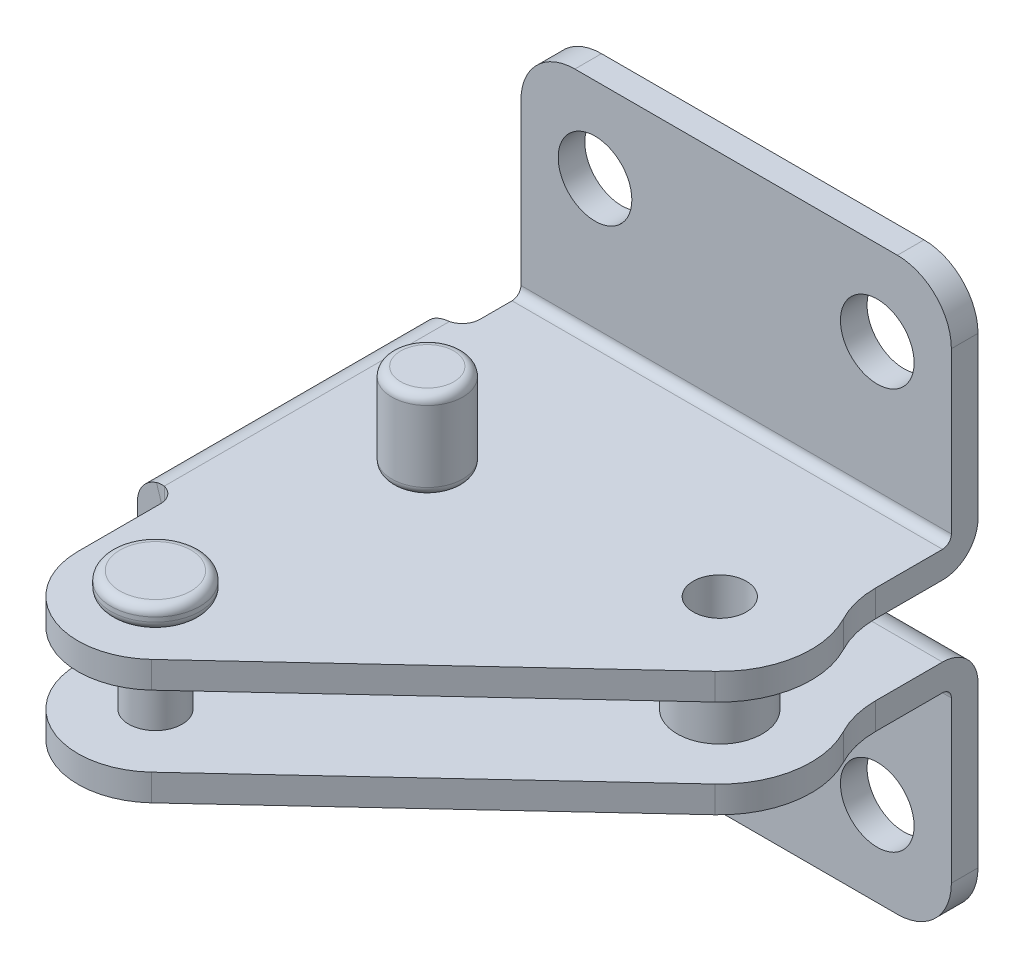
ISO-10303-21;
HEADER;
FILE_DESCRIPTION(('STEP AP214'),'2;1');
FILE_NAME('part.step','',(''),(''),'','','');
FILE_SCHEMA(('AUTOMOTIVE_DESIGN { 1 0 10303 214 1 1 1 1 }'));
ENDSEC;
DATA;
#1=APPLICATION_CONTEXT('core data for automotive mechanical design processes');
#2=APPLICATION_PROTOCOL_DEFINITION('international standard','automotive_design',2000,#1);
#3=PRODUCT_CONTEXT('',#1,'mechanical');
#4=PRODUCT('Part','Part','',(#3));
#5=PRODUCT_RELATED_PRODUCT_CATEGORY('part','',(#4));
#6=PRODUCT_DEFINITION_FORMATION('','',#4);
#7=PRODUCT_DEFINITION_CONTEXT('part definition',#1,'design');
#8=PRODUCT_DEFINITION('design','',#6,#7);
#9=PRODUCT_DEFINITION_SHAPE('','',#8);
#10=(LENGTH_UNIT() NAMED_UNIT(*) SI_UNIT(.MILLI.,.METRE.));
#11=(NAMED_UNIT(*) PLANE_ANGLE_UNIT() SI_UNIT($,.RADIAN.));
#12=(NAMED_UNIT(*) SI_UNIT($,.STERADIAN.) SOLID_ANGLE_UNIT());
#13=UNCERTAINTY_MEASURE_WITH_UNIT(LENGTH_MEASURE(1.E-05),#10,'distance_accuracy_value','');
#14=(GEOMETRIC_REPRESENTATION_CONTEXT(3) GLOBAL_UNCERTAINTY_ASSIGNED_CONTEXT((#13)) GLOBAL_UNIT_ASSIGNED_CONTEXT((#10,
#11,#12)) REPRESENTATION_CONTEXT('',''));
#15=CARTESIAN_POINT('',(0.,0.,0.));
#16=DIRECTION('',(0.,0.,1.));
#17=DIRECTION('',(1.,0.,0.));
#18=AXIS2_PLACEMENT_3D('',#15,#16,#17);
#19=CARTESIAN_POINT('',(0.381250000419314,13.0965045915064,52.9070222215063));
#20=DIRECTION('',(0.,1.,0.));
#21=DIRECTION('',(-0.251223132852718,0.,0.967929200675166));
#22=AXIS2_PLACEMENT_3D('',#19,#20,#21);
#23=PLANE('',#22);
#24=CARTESIAN_POINT('',(0.381250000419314,13.0965045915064,52.9070222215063));
#25=DIRECTION('',(0.,1.,0.));
#26=DIRECTION('',(-0.251223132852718,0.,0.967929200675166));
#27=AXIS2_PLACEMENT_3D('',#24,#25,#26);
#28=CIRCLE('',#27,4.);
#29=CARTESIAN_POINT('',(-0.623642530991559,13.0965045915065,56.778739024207));
#30=VERTEX_POINT('',#29);
#31=EDGE_CURVE('E1889',#30,#30,#28,.F.);
#32=ORIENTED_EDGE('',*,*,#31,.T.);
#33=EDGE_LOOP('',(#32));
#34=FACE_BOUND('',#33,.T.);
#35=ADVANCED_FACE('F14',(#34),#23,.F.);
#36=CARTESIAN_POINT('',(0.3812500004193,14.0965045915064,52.9070222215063));
#37=DIRECTION('',(0.,1.,0.));
#38=DIRECTION('',(-0.251223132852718,0.,0.967929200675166));
#39=AXIS2_PLACEMENT_3D('',#36,#37,#38);
#40=TOROIDAL_SURFACE('',#39,4.,1.);
#41=ORIENTED_EDGE('',*,*,#31,.F.);
#42=EDGE_LOOP('',(#41));
#43=FACE_BOUND('',#42,.T.);
#44=CARTESIAN_POINT('',(0.3812500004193,14.0965045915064,52.9070222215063));
#45=DIRECTION('',(0.,1.,0.));
#46=DIRECTION('',(-0.251223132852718,0.,0.967929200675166));
#47=AXIS2_PLACEMENT_3D('',#44,#45,#46);
#48=CIRCLE('',#47,5.);
#49=CARTESIAN_POINT('',(-0.874865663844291,14.0965045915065,57.7466682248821));
#50=VERTEX_POINT('',#49);
#51=EDGE_CURVE('E1891',#50,#50,#48,.T.);
#52=ORIENTED_EDGE('',*,*,#51,.F.);
#53=EDGE_LOOP('',(#52));
#54=FACE_BOUND('',#53,.T.);
#55=ADVANCED_FACE('F967',(#43,#54),#40,.T.);
#56=CARTESIAN_POINT('',(0.381250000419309,15.5965045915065,52.9070222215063));
#57=DIRECTION('',(0.,-1.,0.));
#58=DIRECTION('',(0.251223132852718,0.,-0.967929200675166));
#59=AXIS2_PLACEMENT_3D('',#56,#57,#58);
#60=CYLINDRICAL_SURFACE('',#59,5.);
#61=ORIENTED_EDGE('',*,*,#51,.T.);
#62=EDGE_LOOP('',(#61));
#63=FACE_BOUND('',#62,.T.);
#64=CARTESIAN_POINT('',(0.381250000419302,14.5965045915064,52.9070222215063));
#65=DIRECTION('',(0.,1.,0.));
#66=DIRECTION('',(-0.251223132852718,0.,0.967929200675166));
#67=AXIS2_PLACEMENT_3D('',#64,#65,#66);
#68=CIRCLE('',#67,5.);
#69=CARTESIAN_POINT('',(-0.874865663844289,14.5965045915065,57.7466682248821));
#70=VERTEX_POINT('',#69);
#71=EDGE_CURVE('E1043',#70,#70,#68,.F.);
#72=ORIENTED_EDGE('',*,*,#71,.T.);
#73=EDGE_LOOP('',(#72));
#74=FACE_BOUND('',#73,.T.);
#75=ADVANCED_FACE('F964',(#63,#74),#60,.T.);
#76=CARTESIAN_POINT('',(0.381250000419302,14.5965045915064,52.9070222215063));
#77=DIRECTION('',(0.,1.,0.));
#78=DIRECTION('',(-0.251223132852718,0.,0.967929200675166));
#79=AXIS2_PLACEMENT_3D('',#76,#77,#78);
#80=TOROIDAL_SURFACE('',#79,4.,1.);
#81=ORIENTED_EDGE('',*,*,#71,.F.);
#82=EDGE_LOOP('',(#81));
#83=FACE_BOUND('',#82,.T.);
#84=CARTESIAN_POINT('',(0.381250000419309,15.5965045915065,52.9070222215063));
#85=DIRECTION('',(0.,1.,0.));
#86=DIRECTION('',(-0.251223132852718,0.,0.967929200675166));
#87=AXIS2_PLACEMENT_3D('',#84,#85,#86);
#88=CIRCLE('',#87,4.);
#89=CARTESIAN_POINT('',(-0.623642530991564,15.5965045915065,56.778739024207));
#90=VERTEX_POINT('',#89);
#91=EDGE_CURVE('E1010',#90,#90,#88,.T.);
#92=ORIENTED_EDGE('',*,*,#91,.F.);
#93=EDGE_LOOP('',(#92));
#94=FACE_BOUND('',#93,.T.);
#95=ADVANCED_FACE('F920',(#83,#94),#80,.T.);
#96=CARTESIAN_POINT('',(0.381250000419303,32.0965045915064,52.9070222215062));
#97=DIRECTION('',(0.,-1.,0.));
#98=DIRECTION('',(-0.251223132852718,0.,0.967929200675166));
#99=AXIS2_PLACEMENT_3D('',#96,#97,#98);
#100=PLANE('',#99);
#101=CARTESIAN_POINT('',(0.381250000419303,32.0965045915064,52.9070222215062));
#102=DIRECTION('',(0.,-1.,0.));
#103=DIRECTION('',(0.251223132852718,0.,-0.967929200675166));
#104=AXIS2_PLACEMENT_3D('',#101,#102,#103);
#105=CIRCLE('',#104,4.);
#106=CARTESIAN_POINT('',(1.38614253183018,32.0965045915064,49.0353054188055));
#107=VERTEX_POINT('',#106);
#108=EDGE_CURVE('E1005',#107,#107,#105,.F.);
#109=ORIENTED_EDGE('',*,*,#108,.T.);
#110=EDGE_LOOP('',(#109));
#111=FACE_BOUND('',#110,.T.);
#112=ADVANCED_FACE('F977',(#111),#100,.F.);
#113=CARTESIAN_POINT('',(0.381250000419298,31.0965045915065,52.9070222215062));
#114=DIRECTION('',(0.,-1.,0.));
#115=DIRECTION('',(0.251223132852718,0.,-0.967929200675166));
#116=AXIS2_PLACEMENT_3D('',#113,#114,#115);
#117=TOROIDAL_SURFACE('',#116,4.,1.);
#118=CARTESIAN_POINT('',(0.381250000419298,31.0965045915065,52.9070222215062));
#119=DIRECTION('',(0.,-1.,0.));
#120=DIRECTION('',(0.251223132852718,0.,-0.967929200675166));
#121=AXIS2_PLACEMENT_3D('',#118,#119,#120);
#122=CIRCLE('',#121,5.);
#123=CARTESIAN_POINT('',(1.63736566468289,31.0965045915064,48.0673762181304));
#124=VERTEX_POINT('',#123);
#125=EDGE_CURVE('E1004',#124,#124,#122,.T.);
#126=ORIENTED_EDGE('',*,*,#125,.F.);
#127=EDGE_LOOP('',(#126));
#128=FACE_BOUND('',#127,.T.);
#129=ORIENTED_EDGE('',*,*,#108,.F.);
#130=EDGE_LOOP('',(#129));
#131=FACE_BOUND('',#130,.T.);
#132=ADVANCED_FACE('F982',(#128,#131),#117,.T.);
#133=CARTESIAN_POINT('',(0.38125000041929,29.5965045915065,52.9070222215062));
#134=DIRECTION('',(0.,1.,0.));
#135=DIRECTION('',(-0.251223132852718,0.,0.967929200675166));
#136=AXIS2_PLACEMENT_3D('',#133,#134,#135);
#137=CYLINDRICAL_SURFACE('',#136,5.);
#138=ORIENTED_EDGE('',*,*,#125,.T.);
#139=EDGE_LOOP('',(#138));
#140=FACE_BOUND('',#139,.T.);
#141=CARTESIAN_POINT('',(0.381250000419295,30.5965045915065,52.9070222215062));
#142=DIRECTION('',(0.,-1.,0.));
#143=DIRECTION('',(0.251223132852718,0.,-0.967929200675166));
#144=AXIS2_PLACEMENT_3D('',#141,#142,#143);
#145=CIRCLE('',#144,5.);
#146=CARTESIAN_POINT('',(1.63736566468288,30.5965045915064,48.0673762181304));
#147=VERTEX_POINT('',#146);
#148=EDGE_CURVE('E1002',#147,#147,#145,.F.);
#149=ORIENTED_EDGE('',*,*,#148,.T.);
#150=EDGE_LOOP('',(#149));
#151=FACE_BOUND('',#150,.T.);
#152=ADVANCED_FACE('F979',(#140,#151),#137,.T.);
#153=CARTESIAN_POINT('',(0.381250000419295,30.5965045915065,52.9070222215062));
#154=DIRECTION('',(0.,-1.,0.));
#155=DIRECTION('',(0.251223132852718,0.,-0.967929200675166));
#156=AXIS2_PLACEMENT_3D('',#153,#154,#155);
#157=TOROIDAL_SURFACE('',#156,4.,1.);
#158=CARTESIAN_POINT('',(0.38125000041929,29.5965045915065,52.9070222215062));
#159=DIRECTION('',(0.,-1.,0.));
#160=DIRECTION('',(0.251223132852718,0.,-0.967929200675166));
#161=AXIS2_PLACEMENT_3D('',#158,#159,#160);
#162=CIRCLE('',#161,4.);
#163=CARTESIAN_POINT('',(1.38614253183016,29.5965045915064,49.0353054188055));
#164=VERTEX_POINT('',#163);
#165=EDGE_CURVE('E999',#164,#164,#162,.T.);
#166=ORIENTED_EDGE('',*,*,#165,.F.);
#167=EDGE_LOOP('',(#166));
#168=FACE_BOUND('',#167,.T.);
#169=ORIENTED_EDGE('',*,*,#148,.F.);
#170=EDGE_LOOP('',(#169));
#171=FACE_BOUND('',#170,.T.);
#172=ADVANCED_FACE('F917',(#168,#171),#157,.T.);
#173=CARTESIAN_POINT('',(0.38125000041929,29.5965045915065,52.9070222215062));
#174=DIRECTION('',(0.,-1.,0.));
#175=DIRECTION('',(0.251223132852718,0.,-0.967929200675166));
#176=AXIS2_PLACEMENT_3D('',#173,#174,#175);
#177=CYLINDRICAL_SURFACE('',#176,3.);
#178=CARTESIAN_POINT('',(0.381250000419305,18.5965045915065,52.9070222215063));
#179=DIRECTION('',(0.,1.,0.));
#180=DIRECTION('',(-1.,0.,0.));
#181=AXIS2_PLACEMENT_3D('',#178,#179,#180);
#182=CIRCLE('',#181,3.);
#183=CARTESIAN_POINT('',(-2.6187499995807,18.5965045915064,52.9070222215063));
#184=VERTEX_POINT('',#183);
#185=EDGE_CURVE('E9',#184,#184,#182,.T.);
#186=ORIENTED_EDGE('',*,*,#185,.T.);
#187=EDGE_LOOP('',(#186));
#188=FACE_BOUND('',#187,.T.);
#189=CARTESIAN_POINT('',(0.381250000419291,26.5965045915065,52.9070222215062));
#190=DIRECTION('',(0.,-1.,0.));
#191=DIRECTION('',(1.,0.,0.));
#192=AXIS2_PLACEMENT_3D('',#189,#190,#191);
#193=CIRCLE('',#192,3.);
#194=CARTESIAN_POINT('',(3.38125000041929,26.5965045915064,52.9070222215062));
#195=VERTEX_POINT('',#194);
#196=EDGE_CURVE('E25',#195,#195,#193,.T.);
#197=ORIENTED_EDGE('',*,*,#196,.T.);
#198=EDGE_LOOP('',(#197));
#199=FACE_BOUND('',#198,.T.);
#200=ADVANCED_FACE('F911',(#188,#199),#177,.T.);
#201=CARTESIAN_POINT('',(3.27,11.5965045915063,25.1665045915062));
#202=DIRECTION('',(0.,1.,0.));
#203=DIRECTION('',(-0.381849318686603,0.,-0.924224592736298));
#204=AXIS2_PLACEMENT_3D('',#201,#202,#203);
#205=PLANE('',#204);
#206=CARTESIAN_POINT('',(3.27,11.5965045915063,25.1665045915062));
#207=DIRECTION('',(0.,1.,0.));
#208=DIRECTION('',(-0.381849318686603,0.,-0.924224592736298));
#209=AXIS2_PLACEMENT_3D('',#206,#207,#208);
#210=CIRCLE('',#209,2.25);
#211=CARTESIAN_POINT('',(2.41083903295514,11.5965045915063,23.0869992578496));
#212=VERTEX_POINT('',#211);
#213=EDGE_CURVE('E1019',#212,#212,#210,.F.);
#214=ORIENTED_EDGE('',*,*,#213,.T.);
#215=EDGE_LOOP('',(#214));
#216=FACE_BOUND('',#215,.T.);
#217=ADVANCED_FACE('F896',(#216),#205,.F.);
#218=CARTESIAN_POINT('',(3.26999999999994,39.5965045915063,25.1665045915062));
#219=DIRECTION('',(0.,1.,0.));
#220=DIRECTION('',(-0.381849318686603,0.,-0.924224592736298));
#221=AXIS2_PLACEMENT_3D('',#218,#219,#220);
#222=PLANE('',#221);
#223=CARTESIAN_POINT('',(3.26999999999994,39.5965045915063,25.1665045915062));
#224=DIRECTION('',(0.,1.,0.));
#225=DIRECTION('',(-0.381849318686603,0.,-0.924224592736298));
#226=AXIS2_PLACEMENT_3D('',#223,#224,#225);
#227=CIRCLE('',#226,3.);
#228=CARTESIAN_POINT('',(2.12445204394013,39.5965045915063,22.3938308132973));
#229=VERTEX_POINT('',#228);
#230=EDGE_CURVE('E1035',#229,#229,#227,.T.);
#231=ORIENTED_EDGE('',*,*,#230,.T.);
#232=EDGE_LOOP('',(#231));
#233=FACE_BOUND('',#232,.T.);
#234=ADVANCED_FACE('F894',(#233),#222,.T.);
#235=CARTESIAN_POINT('',(3.27,12.5965045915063,25.1665045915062));
#236=DIRECTION('',(0.,1.,0.));
#237=DIRECTION('',(-0.381849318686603,0.,-0.924224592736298));
#238=AXIS2_PLACEMENT_3D('',#235,#236,#237);
#239=TOROIDAL_SURFACE('',#238,2.25,1.);
#240=CARTESIAN_POINT('',(3.27,12.5965045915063,25.1665045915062));
#241=DIRECTION('',(0.,1.,0.));
#242=DIRECTION('',(-0.381849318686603,0.,-0.924224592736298));
#243=AXIS2_PLACEMENT_3D('',#240,#241,#242);
#244=CIRCLE('',#243,3.25);
#245=CARTESIAN_POINT('',(2.02898971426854,12.5965045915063,22.1627746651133));
#246=VERTEX_POINT('',#245);
#247=EDGE_CURVE('E1025',#246,#246,#244,.T.);
#248=ORIENTED_EDGE('',*,*,#247,.F.);
#249=EDGE_LOOP('',(#248));
#250=FACE_BOUND('',#249,.T.);
#251=ORIENTED_EDGE('',*,*,#213,.F.);
#252=EDGE_LOOP('',(#251));
#253=FACE_BOUND('',#252,.T.);
#254=ADVANCED_FACE('F879',(#250,#253),#239,.T.);
#255=CARTESIAN_POINT('',(31.8,0.,3.00000000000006));
#256=DIRECTION('',(0.,0.,1.));
#257=DIRECTION('',(1.,0.,0.));
#258=AXIS2_PLACEMENT_3D('',#255,#256,#257);
#259=CYLINDRICAL_SURFACE('',#258,4.15);
#260=CARTESIAN_POINT('',(31.8,0.,0.));
#261=DIRECTION('',(0.,0.,-1.));
#262=DIRECTION('',(-1.,0.,0.));
#263=AXIS2_PLACEMENT_3D('',#260,#261,#262);
#264=CIRCLE('',#263,4.15);
#265=CARTESIAN_POINT('',(27.65,0.,0.));
#266=VERTEX_POINT('',#265);
#267=EDGE_CURVE('E388',#266,#266,#264,.T.);
#268=ORIENTED_EDGE('',*,*,#267,.T.);
#269=EDGE_LOOP('',(#268));
#270=FACE_BOUND('',#269,.T.);
#271=CARTESIAN_POINT('',(31.8,0.,3.00000000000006));
#272=DIRECTION('',(0.,0.,1.));
#273=DIRECTION('',(1.,0.,0.));
#274=AXIS2_PLACEMENT_3D('',#271,#272,#273);
#275=CIRCLE('',#274,4.15);
#276=CARTESIAN_POINT('',(35.95,0.,3.00000000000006));
#277=VERTEX_POINT('',#276);
#278=EDGE_CURVE('E385',#277,#277,#275,.T.);
#279=ORIENTED_EDGE('',*,*,#278,.T.);
#280=EDGE_LOOP('',(#279));
#281=FACE_BOUND('',#280,.T.);
#282=ADVANCED_FACE('F893',(#270,#281),#259,.F.);
#283=CARTESIAN_POINT('',(0.,0.,3.));
#284=DIRECTION('',(0.,0.,1.));
#285=DIRECTION('',(1.,0.,0.));
#286=AXIS2_PLACEMENT_3D('',#283,#284,#285);
#287=CYLINDRICAL_SURFACE('',#286,4.15);
#288=CARTESIAN_POINT('',(0.,0.,0.));
#289=DIRECTION('',(0.,0.,-1.));
#290=DIRECTION('',(-1.,0.,0.));
#291=AXIS2_PLACEMENT_3D('',#288,#289,#290);
#292=CIRCLE('',#291,4.15);
#293=CARTESIAN_POINT('',(-4.15,0.,0.));
#294=VERTEX_POINT('',#293);
#295=EDGE_CURVE('E382',#294,#294,#292,.T.);
#296=ORIENTED_EDGE('',*,*,#295,.T.);
#297=EDGE_LOOP('',(#296));
#298=FACE_BOUND('',#297,.T.);
#299=CARTESIAN_POINT('',(0.,0.,3.));
#300=DIRECTION('',(0.,0.,1.));
#301=DIRECTION('',(1.,0.,0.));
#302=AXIS2_PLACEMENT_3D('',#299,#300,#301);
#303=CIRCLE('',#302,4.15);
#304=CARTESIAN_POINT('',(4.15,0.,3.));
#305=VERTEX_POINT('',#304);
#306=EDGE_CURVE('E379',#305,#305,#303,.T.);
#307=ORIENTED_EDGE('',*,*,#306,.T.);
#308=EDGE_LOOP('',(#307));
#309=FACE_BOUND('',#308,.T.);
#310=ADVANCED_FACE('F902',(#298,#309),#287,.F.);
#311=CARTESIAN_POINT('',(40.15,-3.47874999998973,0.));
#312=DIRECTION('',(-1.,0.,0.));
#313=DIRECTION('',(0.,1.,0.));
#314=AXIS2_PLACEMENT_3D('',#311,#312,#313);
#315=PLANE('',#314);
#316=DIRECTION('',(0.,-1.,0.));
#317=VECTOR('',#316,1.);
#318=CARTESIAN_POINT('',(40.15,21.393017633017,-1.49186218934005E-13));
#319=LINE('',#318,#317);
#320=CARTESIAN_POINT('',(40.15,14.5965045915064,-1.31838984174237E-13));
#321=VERTEX_POINT('',#320);
#322=CARTESIAN_POINT('',(40.15,-3.47874999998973,0.));
#323=VERTEX_POINT('',#322);
#324=EDGE_CURVE('E373',#321,#323,#319,.T.);
#325=ORIENTED_EDGE('',*,*,#324,.F.);
#326=CARTESIAN_POINT('',(40.15,14.5965045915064,3.99999999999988));
#327=DIRECTION('',(-1.,0.,0.));
#328=DIRECTION('',(0.,-1.,0.));
#329=AXIS2_PLACEMENT_3D('',#326,#327,#328);
#330=CIRCLE('',#329,4.);
#331=CARTESIAN_POINT('',(40.15,18.5965045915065,3.99999999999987));
#332=VERTEX_POINT('',#331);
#333=EDGE_CURVE('E410',#332,#321,#330,.T.);
#334=ORIENTED_EDGE('',*,*,#333,.F.);
#335=DIRECTION('',(0.,0.,-1.));
#336=VECTOR('',#335,1.);
#337=CARTESIAN_POINT('',(40.15,18.5965045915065,6.86952222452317));
#338=LINE('',#337,#336);
#339=CARTESIAN_POINT('',(40.15,18.5965045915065,11.5333149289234));
#340=VERTEX_POINT('',#339);
#341=EDGE_CURVE('E611',#340,#332,#338,.T.);
#342=ORIENTED_EDGE('',*,*,#341,.F.);
#343=DIRECTION('',(0.,-1.,0.));
#344=VECTOR('',#343,1.);
#345=CARTESIAN_POINT('',(40.15,18.5965045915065,11.5333149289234));
#346=LINE('',#345,#344);
#347=CARTESIAN_POINT('',(40.15,15.5965045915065,11.5333149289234));
#348=VERTEX_POINT('',#347);
#349=EDGE_CURVE('E648',#340,#348,#346,.T.);
#350=ORIENTED_EDGE('',*,*,#349,.T.);
#351=DIRECTION('',(0.,0.,-1.));
#352=VECTOR('',#351,1.);
#353=CARTESIAN_POINT('',(40.15,15.5965045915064,-18.0022454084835));
#354=LINE('',#353,#352);
#355=CARTESIAN_POINT('',(40.15,15.5965045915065,3.99999999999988));
#356=VERTEX_POINT('',#355);
#357=EDGE_CURVE('E651',#348,#356,#354,.T.);
#358=ORIENTED_EDGE('',*,*,#357,.T.);
#359=CARTESIAN_POINT('',(40.15,14.5965045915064,3.99999999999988));
#360=DIRECTION('',(-1.,0.,0.));
#361=DIRECTION('',(0.,-1.,0.));
#362=AXIS2_PLACEMENT_3D('',#359,#360,#361);
#363=CIRCLE('',#362,1.);
#364=CARTESIAN_POINT('',(40.1500000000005,14.5965045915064,2.99999999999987));
#365=VERTEX_POINT('',#364);
#366=EDGE_CURVE('E411',#356,#365,#363,.T.);
#367=ORIENTED_EDGE('',*,*,#366,.T.);
#368=DIRECTION('',(0.,-1.,0.));
#369=VECTOR('',#368,1.);
#370=CARTESIAN_POINT('',(40.15,-3.47874999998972,3.));
#371=LINE('',#370,#369);
#372=CARTESIAN_POINT('',(40.15,-3.47874999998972,3.));
#373=VERTEX_POINT('',#372);
#374=EDGE_CURVE('E365',#365,#373,#371,.T.);
#375=ORIENTED_EDGE('',*,*,#374,.T.);
#376=DIRECTION('',(0.,0.,1.));
#377=VECTOR('',#376,1.);
#378=CARTESIAN_POINT('',(40.15,-3.47874999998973,0.));
#379=LINE('',#378,#377);
#380=EDGE_CURVE('E391',#323,#373,#379,.T.);
#381=ORIENTED_EDGE('',*,*,#380,.F.);
#382=EDGE_LOOP('',(#325,#334,#342,#350,#358,#367,#375,#381));
#383=FACE_BOUND('',#382,.T.);
#384=ADVANCED_FACE('F957',(#383),#315,.F.);
#385=CARTESIAN_POINT('',(34.0687499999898,-3.47874999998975,0.));
#386=DIRECTION('',(0.,0.,1.));
#387=DIRECTION('',(1.,0.,0.));
#388=AXIS2_PLACEMENT_3D('',#385,#386,#387);
#389=CYLINDRICAL_SURFACE('',#388,6.08125000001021);
#390=CARTESIAN_POINT('',(34.0687499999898,-3.47874999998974,3.));
#391=DIRECTION('',(0.,0.,-1.));
#392=DIRECTION('',(-1.,0.,0.));
#393=AXIS2_PLACEMENT_3D('',#390,#391,#392);
#394=CIRCLE('',#393,6.08125000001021);
#395=CARTESIAN_POINT('',(34.0687499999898,-9.56,3.00000000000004));
#396=VERTEX_POINT('',#395);
#397=EDGE_CURVE('E394',#373,#396,#394,.T.);
#398=ORIENTED_EDGE('',*,*,#397,.T.);
#399=DIRECTION('',(0.,0.,1.));
#400=VECTOR('',#399,1.);
#401=CARTESIAN_POINT('',(34.0687499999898,-9.56,0.));
#402=LINE('',#401,#400);
#403=CARTESIAN_POINT('',(34.0687499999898,-9.56,0.));
#404=VERTEX_POINT('',#403);
#405=EDGE_CURVE('E396',#404,#396,#402,.T.);
#406=ORIENTED_EDGE('',*,*,#405,.F.);
#407=CARTESIAN_POINT('',(34.0687499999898,-3.47874999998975,0.));
#408=DIRECTION('',(0.,0.,-1.));
#409=DIRECTION('',(-1.,0.,0.));
#410=AXIS2_PLACEMENT_3D('',#407,#408,#409);
#411=CIRCLE('',#410,6.08125000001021);
#412=EDGE_CURVE('E371',#323,#404,#411,.T.);
#413=ORIENTED_EDGE('',*,*,#412,.F.);
#414=ORIENTED_EDGE('',*,*,#380,.T.);
#415=EDGE_LOOP('',(#398,#406,#413,#414));
#416=FACE_BOUND('',#415,.T.);
#417=ADVANCED_FACE('F960',(#416),#389,.T.);
#418=CARTESIAN_POINT('',(34.0687499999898,-9.56,0.));
#419=DIRECTION('',(0.,1.,0.));
#420=DIRECTION('',(1.,0.,0.));
#421=AXIS2_PLACEMENT_3D('',#418,#419,#420);
#422=PLANE('',#421);
#423=DIRECTION('',(-1.,0.,0.));
#424=VECTOR('',#423,1.);
#425=CARTESIAN_POINT('',(34.0687499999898,-9.56,3.00000000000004));
#426=LINE('',#425,#424);
#427=CARTESIAN_POINT('',(-2.2687499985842,-9.56,3.00000000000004));
#428=VERTEX_POINT('',#427);
#429=EDGE_CURVE('E399',#396,#428,#426,.T.);
#430=ORIENTED_EDGE('',*,*,#429,.T.);
#431=DIRECTION('',(0.,0.,1.));
#432=VECTOR('',#431,1.);
#433=CARTESIAN_POINT('',(-2.2687499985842,-9.56,0.));
#434=LINE('',#433,#432);
#435=CARTESIAN_POINT('',(-2.2687499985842,-9.56,0.));
#436=VERTEX_POINT('',#435);
#437=EDGE_CURVE('E401',#436,#428,#434,.T.);
#438=ORIENTED_EDGE('',*,*,#437,.F.);
#439=DIRECTION('',(-1.,0.,0.));
#440=VECTOR('',#439,1.);
#441=CARTESIAN_POINT('',(34.0687499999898,-9.56,0.));
#442=LINE('',#441,#440);
#443=EDGE_CURVE('E369',#404,#436,#442,.T.);
#444=ORIENTED_EDGE('',*,*,#443,.F.);
#445=ORIENTED_EDGE('',*,*,#405,.T.);
#446=EDGE_LOOP('',(#430,#438,#444,#445));
#447=FACE_BOUND('',#446,.T.);
#448=ADVANCED_FACE('F1353',(#447),#422,.F.);
#449=CARTESIAN_POINT('',(-2.2687499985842,-3.47874999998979,0.));
#450=DIRECTION('',(0.,0.,1.));
#451=DIRECTION('',(1.,0.,0.));
#452=AXIS2_PLACEMENT_3D('',#449,#450,#451);
#453=CYLINDRICAL_SURFACE('',#452,6.08125000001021);
#454=CARTESIAN_POINT('',(-2.2687499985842,-3.47874999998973,3.));
#455=DIRECTION('',(0.,0.,-1.));
#456=DIRECTION('',(-1.,0.,0.));
#457=AXIS2_PLACEMENT_3D('',#454,#455,#456);
#458=CIRCLE('',#457,6.08125000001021);
#459=CARTESIAN_POINT('',(-8.3499999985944,-3.4787499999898,3.));
#460=VERTEX_POINT('',#459);
#461=EDGE_CURVE('E404',#428,#460,#458,.T.);
#462=ORIENTED_EDGE('',*,*,#461,.T.);
#463=DIRECTION('',(0.,0.,1.));
#464=VECTOR('',#463,1.);
#465=CARTESIAN_POINT('',(-8.3499999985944,-3.47874999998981,0.));
#466=LINE('',#465,#464);
#467=CARTESIAN_POINT('',(-8.3499999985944,-3.47874999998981,0.));
#468=VERTEX_POINT('',#467);
#469=EDGE_CURVE('E362',#468,#460,#466,.T.);
#470=ORIENTED_EDGE('',*,*,#469,.F.);
#471=CARTESIAN_POINT('',(-2.2687499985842,-3.47874999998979,0.));
#472=DIRECTION('',(0.,0.,-1.));
#473=DIRECTION('',(-1.,0.,0.));
#474=AXIS2_PLACEMENT_3D('',#471,#472,#473);
#475=CIRCLE('',#474,6.08125000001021);
#476=EDGE_CURVE('E367',#436,#468,#475,.T.);
#477=ORIENTED_EDGE('',*,*,#476,.F.);
#478=ORIENTED_EDGE('',*,*,#437,.T.);
#479=EDGE_LOOP('',(#462,#470,#477,#478));
#480=FACE_BOUND('',#479,.T.);
#481=ADVANCED_FACE('F958',(#480),#453,.T.);
#482=CARTESIAN_POINT('',(-8.3499999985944,-3.47874999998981,0.));
#483=DIRECTION('',(1.,0.,0.));
#484=DIRECTION('',(0.,0.,-1.));
#485=AXIS2_PLACEMENT_3D('',#482,#483,#484);
#486=PLANE('',#485);
#487=DIRECTION('',(0.,1.,0.));
#488=VECTOR('',#487,1.);
#489=CARTESIAN_POINT('',(-8.3499999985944,-3.4787499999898,3.));
#490=LINE('',#489,#488);
#491=CARTESIAN_POINT('',(-8.34999999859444,14.5965045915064,2.99999999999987));
#492=VERTEX_POINT('',#491);
#493=EDGE_CURVE('E360',#460,#492,#490,.T.);
#494=ORIENTED_EDGE('',*,*,#493,.T.);
#495=CARTESIAN_POINT('',(-8.34999999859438,14.5965045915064,3.99999999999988));
#496=DIRECTION('',(-1.,0.,0.));
#497=DIRECTION('',(0.,-1.,0.));
#498=AXIS2_PLACEMENT_3D('',#495,#496,#497);
#499=CIRCLE('',#498,1.);
#500=CARTESIAN_POINT('',(-8.34999999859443,15.5965045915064,3.99999999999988));
#501=VERTEX_POINT('',#500);
#502=EDGE_CURVE('E41',#492,#501,#499,.F.);
#503=ORIENTED_EDGE('',*,*,#502,.T.);
#504=DIRECTION('',(0.,0.,1.));
#505=VECTOR('',#504,1.);
#506=CARTESIAN_POINT('',(-8.34999999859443,15.5965045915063,-18.0022454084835));
#507=LINE('',#506,#505);
#508=CARTESIAN_POINT('',(-8.34999999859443,15.5965045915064,7.61019299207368));
#509=VERTEX_POINT('',#508);
#510=EDGE_CURVE('E1141',#501,#509,#507,.T.);
#511=ORIENTED_EDGE('',*,*,#510,.T.);
#512=DIRECTION('',(0.,-1.,0.));
#513=VECTOR('',#512,1.);
#514=CARTESIAN_POINT('',(-8.34999999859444,18.5965045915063,7.61019299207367));
#515=LINE('',#514,#513);
#516=CARTESIAN_POINT('',(-8.34999999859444,18.5965045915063,7.61019299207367));
#517=VERTEX_POINT('',#516);
#518=EDGE_CURVE('E599',#517,#509,#515,.T.);
#519=ORIENTED_EDGE('',*,*,#518,.F.);
#520=DIRECTION('',(0.,0.,1.));
#521=VECTOR('',#520,1.);
#522=CARTESIAN_POINT('',(-8.34999999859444,18.5965045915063,-18.0022454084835));
#523=LINE('',#522,#521);
#524=CARTESIAN_POINT('',(-8.34999999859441,18.5965045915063,3.99999999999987));
#525=VERTEX_POINT('',#524);
#526=EDGE_CURVE('E1147',#525,#517,#523,.T.);
#527=ORIENTED_EDGE('',*,*,#526,.F.);
#528=CARTESIAN_POINT('',(-8.34999999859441,14.5965045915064,3.99999999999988));
#529=DIRECTION('',(1.,0.,0.));
#530=DIRECTION('',(0.,1.,0.));
#531=AXIS2_PLACEMENT_3D('',#528,#529,#530);
#532=CIRCLE('',#531,4.);
#533=CARTESIAN_POINT('',(-8.34999999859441,14.5965045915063,-1.31838984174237E-13));
#534=VERTEX_POINT('',#533);
#535=EDGE_CURVE('E408',#534,#525,#532,.T.);
#536=ORIENTED_EDGE('',*,*,#535,.F.);
#537=DIRECTION('',(0.,1.,0.));
#538=VECTOR('',#537,1.);
#539=CARTESIAN_POINT('',(-8.3499999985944,-3.47874999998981,0.));
#540=LINE('',#539,#538);
#541=EDGE_CURVE('E377',#468,#534,#540,.T.);
#542=ORIENTED_EDGE('',*,*,#541,.F.);
#543=ORIENTED_EDGE('',*,*,#469,.T.);
#544=EDGE_LOOP('',(#494,#503,#511,#519,#527,#536,#542,#543));
#545=FACE_BOUND('',#544,.T.);
#546=ADVANCED_FACE('F905',(#545),#486,.F.);
#547=CARTESIAN_POINT('',(3.26999999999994,38.5965045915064,25.1665045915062));
#548=DIRECTION('',(0.,1.,0.));
#549=DIRECTION('',(-0.381849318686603,0.,-0.924224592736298));
#550=AXIS2_PLACEMENT_3D('',#547,#548,#549);
#551=TOROIDAL_SURFACE('',#550,3.,1.);
#552=CARTESIAN_POINT('',(3.26999999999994,38.5965045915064,25.1665045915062));
#553=DIRECTION('',(0.,1.,0.));
#554=DIRECTION('',(-0.381849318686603,0.,-0.924224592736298));
#555=AXIS2_PLACEMENT_3D('',#552,#553,#554);
#556=CIRCLE('',#555,4.);
#557=CARTESIAN_POINT('',(1.74260272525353,38.5965045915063,21.469606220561));
#558=VERTEX_POINT('',#557);
#559=EDGE_CURVE('E1027',#558,#558,#556,.F.);
#560=ORIENTED_EDGE('',*,*,#559,.F.);
#561=EDGE_LOOP('',(#560));
#562=FACE_BOUND('',#561,.T.);
#563=ORIENTED_EDGE('',*,*,#230,.F.);
#564=EDGE_LOOP('',(#563));
#565=FACE_BOUND('',#564,.T.);
#566=ADVANCED_FACE('F907',(#562,#565),#551,.T.);
#567=CARTESIAN_POINT('',(-9.95546384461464,16.6777666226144,41.6101929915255));
#568=DIRECTION('',(0.,0.,-1.));
#569=DIRECTION('',(-1.,0.,0.));
#570=AXIS2_PLACEMENT_3D('',#567,#568,#569);
#571=PLANE('',#570);
#572=DIRECTION('',(0.,-1.,0.));
#573=VECTOR('',#572,1.);
#574=CARTESIAN_POINT('',(-9.95546384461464,16.6777666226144,41.6101929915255));
#575=LINE('',#574,#573);
#576=CARTESIAN_POINT('',(-9.95546384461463,26.4965045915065,41.6101929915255));
#577=VERTEX_POINT('',#576);
#578=CARTESIAN_POINT('',(-9.95546384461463,18.6965045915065,41.6101929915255));
#579=VERTEX_POINT('',#578);
#580=EDGE_CURVE('E1298',#577,#579,#575,.T.);
#581=ORIENTED_EDGE('',*,*,#580,.F.);
#582=CARTESIAN_POINT('',(-9.85546384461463,26.4965045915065,41.6101929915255));
#583=DIRECTION('',(0.,0.,1.));
#584=DIRECTION('',(1.,0.,0.));
#585=AXIS2_PLACEMENT_3D('',#582,#583,#584);
#586=CIRCLE('',#585,0.1);
#587=CARTESIAN_POINT('',(-9.88588256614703,26.5917658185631,41.6101929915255));
#588=VERTEX_POINT('',#587);
#589=EDGE_CURVE('E477',#588,#577,#586,.T.);
#590=ORIENTED_EDGE('',*,*,#589,.F.);
#591=CARTESIAN_POINT('',(-10.7984442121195,29.4496026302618,41.6101929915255));
#592=CARTESIAN_POINT('',(-9.88588256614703,26.5917658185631,41.6101929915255));
#593=B_SPLINE_CURVE_WITH_KNOTS('',1,(#591,#592),.UNSPECIFIED.,.F.,.F.,(2,2),(0.,1.),.UNSPECIFIED.);
#594=CARTESIAN_POINT('',(-10.7984442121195,29.4496026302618,41.6101929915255));
#595=VERTEX_POINT('',#594);
#596=EDGE_CURVE('E522',#595,#588,#593,.T.);
#597=ORIENTED_EDGE('',*,*,#596,.F.);
#598=CARTESIAN_POINT('',(-9.85546384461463,26.4965045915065,41.6101929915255));
#599=DIRECTION('',(0.,0.,1.));
#600=DIRECTION('',(0.,-1.,0.));
#601=AXIS2_PLACEMENT_3D('',#598,#599,#600);
#602=CIRCLE('',#601,3.1);
#603=CARTESIAN_POINT('',(-12.9554638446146,26.4965045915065,41.6101929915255));
#604=VERTEX_POINT('',#603);
#605=EDGE_CURVE('E466',#595,#604,#602,.T.);
#606=ORIENTED_EDGE('',*,*,#605,.T.);
#607=DIRECTION('',(0.,-1.,0.));
#608=VECTOR('',#607,1.);
#609=CARTESIAN_POINT('',(-12.9554638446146,16.6777666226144,41.6101929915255));
#610=LINE('',#609,#608);
#611=CARTESIAN_POINT('',(-12.9554638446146,18.6965045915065,41.6101929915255));
#612=VERTEX_POINT('',#611);
#613=EDGE_CURVE('E1293',#604,#612,#610,.T.);
#614=ORIENTED_EDGE('',*,*,#613,.T.);
#615=CARTESIAN_POINT('',(-9.85546384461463,18.6965045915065,41.6101929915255));
#616=DIRECTION('',(0.,0.,-1.));
#617=DIRECTION('',(0.,1.,0.));
#618=AXIS2_PLACEMENT_3D('',#615,#616,#617);
#619=CIRCLE('',#618,3.1);
#620=CARTESIAN_POINT('',(-10.7984442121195,15.7434065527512,41.6101929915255));
#621=VERTEX_POINT('',#620);
#622=EDGE_CURVE('E654',#612,#621,#619,.F.);
#623=ORIENTED_EDGE('',*,*,#622,.T.);
#624=CARTESIAN_POINT('',(-9.88588256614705,18.6012433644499,41.6101929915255));
#625=CARTESIAN_POINT('',(-10.7984442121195,15.7434065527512,41.6101929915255));
#626=B_SPLINE_CURVE_WITH_KNOTS('',1,(#624,#625),.UNSPECIFIED.,.F.,.F.,(2,2),(0.,1.),.UNSPECIFIED.);
#627=CARTESIAN_POINT('',(-9.88588256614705,18.6012433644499,41.6101929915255));
#628=VERTEX_POINT('',#627);
#629=EDGE_CURVE('E775',#621,#628,#626,.F.);
#630=ORIENTED_EDGE('',*,*,#629,.T.);
#631=CARTESIAN_POINT('',(-9.85546384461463,18.6965045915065,41.6101929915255));
#632=DIRECTION('',(0.,0.,1.));
#633=DIRECTION('',(1.,0.,0.));
#634=AXIS2_PLACEMENT_3D('',#631,#632,#633);
#635=CIRCLE('',#634,0.1);
#636=EDGE_CURVE('E705',#579,#628,#635,.T.);
#637=ORIENTED_EDGE('',*,*,#636,.F.);
#638=EDGE_LOOP('',(#581,#590,#597,#606,#614,#623,#630,#637));
#639=FACE_BOUND('',#638,.T.);
#640=ADVANCED_FACE('F949',(#639),#571,.F.);
#641=CARTESIAN_POINT('',(-9.95546384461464,16.6777666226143,9.61019299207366));
#642=DIRECTION('',(0.,0.,1.));
#643=DIRECTION('',(1.,0.,0.));
#644=AXIS2_PLACEMENT_3D('',#641,#642,#643);
#645=PLANE('',#644);
#646=DIRECTION('',(0.,1.,0.));
#647=VECTOR('',#646,1.);
#648=CARTESIAN_POINT('',(-12.9554638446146,16.6777666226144,9.61019299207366));
#649=LINE('',#648,#647);
#650=CARTESIAN_POINT('',(-12.9554638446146,18.6965045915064,9.61019299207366));
#651=VERTEX_POINT('',#650);
#652=CARTESIAN_POINT('',(-12.9554638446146,26.4965045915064,9.61019299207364));
#653=VERTEX_POINT('',#652);
#654=EDGE_CURVE('E1296',#651,#653,#649,.T.);
#655=ORIENTED_EDGE('',*,*,#654,.T.);
#656=CARTESIAN_POINT('',(-9.85546384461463,26.4965045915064,9.61019299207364));
#657=DIRECTION('',(0.,0.,1.));
#658=DIRECTION('',(0.,-1.,0.));
#659=AXIS2_PLACEMENT_3D('',#656,#657,#658);
#660=CIRCLE('',#659,3.1);
#661=CARTESIAN_POINT('',(-10.7984442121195,29.4496026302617,9.61019299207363));
#662=VERTEX_POINT('',#661);
#663=EDGE_CURVE('E469',#653,#662,#660,.F.);
#664=ORIENTED_EDGE('',*,*,#663,.T.);
#665=CARTESIAN_POINT('',(-9.88588256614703,26.5917658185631,9.61019299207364));
#666=CARTESIAN_POINT('',(-10.7984442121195,29.4496026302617,9.61019299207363));
#667=B_SPLINE_CURVE_WITH_KNOTS('',1,(#665,#666),.UNSPECIFIED.,.F.,.F.,(2,2),(0.,1.),.UNSPECIFIED.);
#668=CARTESIAN_POINT('',(-9.88588256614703,26.5917658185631,9.61019299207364));
#669=VERTEX_POINT('',#668);
#670=EDGE_CURVE('E595',#662,#669,#667,.F.);
#671=ORIENTED_EDGE('',*,*,#670,.T.);
#672=CARTESIAN_POINT('',(-9.85546384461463,26.4965045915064,9.61019299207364));
#673=DIRECTION('',(0.,0.,-1.));
#674=DIRECTION('',(-1.,0.,0.));
#675=AXIS2_PLACEMENT_3D('',#672,#673,#674);
#676=CIRCLE('',#675,0.1);
#677=CARTESIAN_POINT('',(-9.95546384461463,26.4965045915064,9.61019299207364));
#678=VERTEX_POINT('',#677);
#679=EDGE_CURVE('E520',#678,#669,#676,.T.);
#680=ORIENTED_EDGE('',*,*,#679,.F.);
#681=DIRECTION('',(0.,1.,0.));
#682=VECTOR('',#681,1.);
#683=CARTESIAN_POINT('',(-9.95546384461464,16.6777666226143,9.61019299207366));
#684=LINE('',#683,#682);
#685=CARTESIAN_POINT('',(-9.95546384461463,18.6965045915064,9.61019299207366));
#686=VERTEX_POINT('',#685);
#687=EDGE_CURVE('E787',#686,#678,#684,.T.);
#688=ORIENTED_EDGE('',*,*,#687,.F.);
#689=CARTESIAN_POINT('',(-9.85546384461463,18.6965045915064,9.61019299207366));
#690=DIRECTION('',(0.,0.,-1.));
#691=DIRECTION('',(-1.,0.,0.));
#692=AXIS2_PLACEMENT_3D('',#689,#690,#691);
#693=CIRCLE('',#692,0.1);
#694=CARTESIAN_POINT('',(-9.88588256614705,18.6012433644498,9.61019299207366));
#695=VERTEX_POINT('',#694);
#696=EDGE_CURVE('E662',#695,#686,#693,.T.);
#697=ORIENTED_EDGE('',*,*,#696,.F.);
#698=CARTESIAN_POINT('',(-10.7984442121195,15.7434065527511,9.61019299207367));
#699=CARTESIAN_POINT('',(-9.88588256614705,18.6012433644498,9.61019299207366));
#700=B_SPLINE_CURVE_WITH_KNOTS('',1,(#698,#699),.UNSPECIFIED.,.F.,.F.,(2,2),(0.,1.),.UNSPECIFIED.);
#701=CARTESIAN_POINT('',(-10.7984442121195,15.7434065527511,9.61019299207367));
#702=VERTEX_POINT('',#701);
#703=EDGE_CURVE('E1260',#702,#695,#700,.T.);
#704=ORIENTED_EDGE('',*,*,#703,.F.);
#705=CARTESIAN_POINT('',(-9.85546384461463,18.6965045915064,9.61019299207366));
#706=DIRECTION('',(0.,0.,-1.));
#707=DIRECTION('',(0.,1.,0.));
#708=AXIS2_PLACEMENT_3D('',#705,#706,#707);
#709=CIRCLE('',#708,3.1);
#710=EDGE_CURVE('E652',#702,#651,#709,.T.);
#711=ORIENTED_EDGE('',*,*,#710,.T.);
#712=EDGE_LOOP('',(#655,#664,#671,#680,#688,#697,#704,#711));
#713=FACE_BOUND('',#712,.T.);
#714=ADVANCED_FACE('F750',(#713),#645,.F.);
#715=CARTESIAN_POINT('',(31.8,45.1930091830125,-11.));
#716=DIRECTION('',(0.,0.,-1.));
#717=DIRECTION('',(1.,0.,0.));
#718=AXIS2_PLACEMENT_3D('',#715,#716,#717);
#719=CYLINDRICAL_SURFACE('',#718,4.15);
#720=CARTESIAN_POINT('',(31.8,45.1930091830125,-1.70002900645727E-13));
#721=DIRECTION('',(0.,0.,-1.));
#722=DIRECTION('',(1.,0.,0.));
#723=AXIS2_PLACEMENT_3D('',#720,#721,#722);
#724=CIRCLE('',#723,4.15);
#725=CARTESIAN_POINT('',(35.95,45.1930091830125,-1.70002900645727E-13));
#726=VERTEX_POINT('',#725);
#727=EDGE_CURVE('E332',#726,#726,#724,.T.);
#728=ORIENTED_EDGE('',*,*,#727,.T.);
#729=EDGE_LOOP('',(#728));
#730=FACE_BOUND('',#729,.T.);
#731=CARTESIAN_POINT('',(31.8,45.1930091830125,2.99999999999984));
#732=DIRECTION('',(0.,0.,-1.));
#733=DIRECTION('',(1.,0.,0.));
#734=AXIS2_PLACEMENT_3D('',#731,#732,#733);
#735=CIRCLE('',#734,4.15);
#736=CARTESIAN_POINT('',(35.95,45.1930091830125,2.99999999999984));
#737=VERTEX_POINT('',#736);
#738=EDGE_CURVE('E313',#737,#737,#735,.T.);
#739=ORIENTED_EDGE('',*,*,#738,.F.);
#740=EDGE_LOOP('',(#739));
#741=FACE_BOUND('',#740,.T.);
#742=ADVANCED_FACE('F1208',(#730,#741),#719,.F.);
#743=CARTESIAN_POINT('',(1.38777878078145E-13,45.1930091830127,-11.0000000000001));
#744=DIRECTION('',(0.,0.,-1.));
#745=DIRECTION('',(1.,0.,0.));
#746=AXIS2_PLACEMENT_3D('',#743,#744,#745);
#747=CYLINDRICAL_SURFACE('',#746,4.15);
#748=CARTESIAN_POINT('',(0.,45.1930091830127,-1.70002900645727E-13));
#749=DIRECTION('',(0.,0.,-1.));
#750=DIRECTION('',(1.,0.,0.));
#751=AXIS2_PLACEMENT_3D('',#748,#749,#750);
#752=CIRCLE('',#751,4.15);
#753=CARTESIAN_POINT('',(4.15000000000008,45.1930091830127,-1.70002900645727E-13));
#754=VERTEX_POINT('',#753);
#755=EDGE_CURVE('E297',#754,#754,#752,.T.);
#756=ORIENTED_EDGE('',*,*,#755,.T.);
#757=EDGE_LOOP('',(#756));
#758=FACE_BOUND('',#757,.T.);
#759=CARTESIAN_POINT('',(0.,45.1930091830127,2.99999999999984));
#760=DIRECTION('',(0.,0.,-1.));
#761=DIRECTION('',(1.,0.,0.));
#762=AXIS2_PLACEMENT_3D('',#759,#760,#761);
#763=CIRCLE('',#762,4.15);
#764=CARTESIAN_POINT('',(4.15000000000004,45.1930091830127,2.99999999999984));
#765=VERTEX_POINT('',#764);
#766=EDGE_CURVE('E317',#765,#765,#763,.T.);
#767=ORIENTED_EDGE('',*,*,#766,.F.);
#768=EDGE_LOOP('',(#767));
#769=FACE_BOUND('',#768,.T.);
#770=ADVANCED_FACE('F1198',(#758,#769),#747,.F.);
#771=CARTESIAN_POINT('',(-8.35000000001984,48.6717591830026,-1.2490009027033E-13));
#772=DIRECTION('',(1.,5.56522696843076E-11,0.));
#773=DIRECTION('',(5.56522696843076E-11,-1.,0.));
#774=AXIS2_PLACEMENT_3D('',#771,#772,#773);
#775=PLANE('',#774);
#776=DIRECTION('',(-5.56522696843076E-11,1.,0.));
#777=VECTOR('',#776,1.);
#778=CARTESIAN_POINT('',(-8.35000000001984,48.6717591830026,-1.2490009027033E-13));
#779=LINE('',#778,#777);
#780=CARTESIAN_POINT('',(-8.3499999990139,30.5965045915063,-1.76941794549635E-13));
#781=VERTEX_POINT('',#780);
#782=CARTESIAN_POINT('',(-8.35000000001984,48.6717591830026,-1.2490009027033E-13));
#783=VERTEX_POINT('',#782);
#784=EDGE_CURVE('E327',#781,#783,#779,.T.);
#785=ORIENTED_EDGE('',*,*,#784,.F.);
#786=CARTESIAN_POINT('',(-8.34999999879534,30.5965045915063,3.99999999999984));
#787=DIRECTION('',(1.,0.,-3.49310598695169E-11));
#788=DIRECTION('',(-3.49310598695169E-11,0.,-1.));
#789=AXIS2_PLACEMENT_3D('',#786,#787,#788);
#790=CIRCLE('',#789,4.);
#791=CARTESIAN_POINT('',(-8.34999999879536,26.5965045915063,3.99999999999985));
#792=VERTEX_POINT('',#791);
#793=EDGE_CURVE('E352',#792,#781,#790,.T.);
#794=ORIENTED_EDGE('',*,*,#793,.F.);
#795=DIRECTION('',(-5.5658028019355E-11,0.,-1.));
#796=VECTOR('',#795,1.);
#797=CARTESIAN_POINT('',(-8.35000000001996,26.5965045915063,-18.0022454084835));
#798=LINE('',#797,#796);
#799=CARTESIAN_POINT('',(-8.34999999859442,26.5965045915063,7.61019299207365));
#800=VERTEX_POINT('',#799);
#801=EDGE_CURVE('E1155',#800,#792,#798,.T.);
#802=ORIENTED_EDGE('',*,*,#801,.F.);
#803=DIRECTION('',(0.,1.,0.));
#804=VECTOR('',#803,1.);
#805=CARTESIAN_POINT('',(-8.34999999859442,26.5965045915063,7.61019299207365));
#806=LINE('',#805,#804);
#807=CARTESIAN_POINT('',(-8.3499999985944,29.5965045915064,7.61019299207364));
#808=VERTEX_POINT('',#807);
#809=EDGE_CURVE('E435',#800,#808,#806,.T.);
#810=ORIENTED_EDGE('',*,*,#809,.T.);
#811=DIRECTION('',(-5.5658028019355E-11,0.,-1.));
#812=VECTOR('',#811,1.);
#813=CARTESIAN_POINT('',(-8.35000000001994,29.5965045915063,-18.0022454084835));
#814=LINE('',#813,#812);
#815=CARTESIAN_POINT('',(-8.34999999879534,29.5965045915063,3.99999999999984));
#816=VERTEX_POINT('',#815);
#817=EDGE_CURVE('E439',#808,#816,#814,.T.);
#818=ORIENTED_EDGE('',*,*,#817,.T.);
#819=CARTESIAN_POINT('',(-8.34999999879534,30.5965045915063,3.99999999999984));
#820=DIRECTION('',(1.,0.,-3.49310598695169E-11));
#821=DIRECTION('',(-3.49310598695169E-11,0.,-1.));
#822=AXIS2_PLACEMENT_3D('',#819,#820,#821);
#823=CIRCLE('',#822,1.);
#824=CARTESIAN_POINT('',(-8.3499999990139,30.5965045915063,2.99999999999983));
#825=VERTEX_POINT('',#824);
#826=EDGE_CURVE('E353',#816,#825,#823,.T.);
#827=ORIENTED_EDGE('',*,*,#826,.T.);
#828=DIRECTION('',(-5.56522696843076E-11,1.,0.));
#829=VECTOR('',#828,1.);
#830=CARTESIAN_POINT('',(-8.35000000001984,48.6717591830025,2.99999999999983));
#831=LINE('',#830,#829);
#832=CARTESIAN_POINT('',(-8.35000000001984,48.6717591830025,2.99999999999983));
#833=VERTEX_POINT('',#832);
#834=EDGE_CURVE('E307',#825,#833,#831,.T.);
#835=ORIENTED_EDGE('',*,*,#834,.T.);
#836=DIRECTION('',(0.,0.,1.));
#837=VECTOR('',#836,1.);
#838=CARTESIAN_POINT('',(-8.35000000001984,48.6717591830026,-1.2490009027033E-13));
#839=LINE('',#838,#837);
#840=EDGE_CURVE('E335',#783,#833,#839,.T.);
#841=ORIENTED_EDGE('',*,*,#840,.F.);
#842=EDGE_LOOP('',(#785,#794,#802,#810,#818,#827,#835,#841));
#843=FACE_BOUND('',#842,.T.);
#844=ADVANCED_FACE('F1185',(#843),#775,.F.);
#845=CARTESIAN_POINT('',(-2.26875000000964,48.6717591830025,-1.2490009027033E-13));
#846=DIRECTION('',(0.,0.,1.));
#847=DIRECTION('',(-1.,0.,0.));
#848=AXIS2_PLACEMENT_3D('',#845,#846,#847);
#849=CYLINDRICAL_SURFACE('',#848,6.08125000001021);
#850=CARTESIAN_POINT('',(-2.26875000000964,48.6717591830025,2.99999999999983));
#851=DIRECTION('',(0.,0.,-1.));
#852=DIRECTION('',(1.,0.,0.));
#853=AXIS2_PLACEMENT_3D('',#850,#851,#852);
#854=CIRCLE('',#853,6.08125000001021);
#855=CARTESIAN_POINT('',(-2.26875000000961,54.7530091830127,2.99999999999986));
#856=VERTEX_POINT('',#855);
#857=EDGE_CURVE('E338',#833,#856,#854,.T.);
#858=ORIENTED_EDGE('',*,*,#857,.T.);
#859=DIRECTION('',(0.,0.,1.));
#860=VECTOR('',#859,1.);
#861=CARTESIAN_POINT('',(-2.26875000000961,54.7530091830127,-1.42247325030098E-13));
#862=LINE('',#861,#860);
#863=CARTESIAN_POINT('',(-2.26875000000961,54.7530091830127,-1.42247325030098E-13));
#864=VERTEX_POINT('',#863);
#865=EDGE_CURVE('E340',#864,#856,#862,.T.);
#866=ORIENTED_EDGE('',*,*,#865,.F.);
#867=CARTESIAN_POINT('',(-2.26875000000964,48.6717591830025,-1.2490009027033E-13));
#868=DIRECTION('',(0.,0.,-1.));
#869=DIRECTION('',(1.,0.,0.));
#870=AXIS2_PLACEMENT_3D('',#867,#868,#869);
#871=CIRCLE('',#870,6.08125000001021);
#872=EDGE_CURVE('E325',#783,#864,#871,.T.);
#873=ORIENTED_EDGE('',*,*,#872,.F.);
#874=ORIENTED_EDGE('',*,*,#840,.T.);
#875=EDGE_LOOP('',(#858,#866,#873,#874));
#876=FACE_BOUND('',#875,.T.);
#877=ADVANCED_FACE('F1197',(#876),#849,.T.);
#878=CARTESIAN_POINT('',(34.0687499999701,54.7530091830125,-1.42247325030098E-13));
#879=DIRECTION('',(0.,-1.,0.));
#880=DIRECTION('',(0.,0.,-1.));
#881=AXIS2_PLACEMENT_3D('',#878,#879,#880);
#882=PLANE('',#881);
#883=DIRECTION('',(1.,0.,0.));
#884=VECTOR('',#883,1.);
#885=CARTESIAN_POINT('',(34.0687499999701,54.7530091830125,2.99999999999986));
#886=LINE('',#885,#884);
#887=CARTESIAN_POINT('',(34.0687499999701,54.7530091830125,2.99999999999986));
#888=VERTEX_POINT('',#887);
#889=EDGE_CURVE('E343',#856,#888,#886,.T.);
#890=ORIENTED_EDGE('',*,*,#889,.T.);
#891=DIRECTION('',(0.,0.,1.));
#892=VECTOR('',#891,1.);
#893=CARTESIAN_POINT('',(34.0687499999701,54.7530091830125,-1.42247325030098E-13));
#894=LINE('',#893,#892);
#895=CARTESIAN_POINT('',(34.0687499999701,54.7530091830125,-1.42247325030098E-13));
#896=VERTEX_POINT('',#895);
#897=EDGE_CURVE('E345',#896,#888,#894,.T.);
#898=ORIENTED_EDGE('',*,*,#897,.F.);
#899=DIRECTION('',(1.,0.,0.));
#900=VECTOR('',#899,1.);
#901=CARTESIAN_POINT('',(34.0687499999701,54.7530091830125,-1.42247325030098E-13));
#902=LINE('',#901,#900);
#903=EDGE_CURVE('E303',#864,#896,#902,.T.);
#904=ORIENTED_EDGE('',*,*,#903,.F.);
#905=ORIENTED_EDGE('',*,*,#865,.T.);
#906=EDGE_LOOP('',(#890,#898,#904,#905));
#907=FACE_BOUND('',#906,.T.);
#908=ADVANCED_FACE('F1205',(#907),#882,.F.);
#909=CARTESIAN_POINT('',(34.0687499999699,48.6717591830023,-1.2490009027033E-13));
#910=DIRECTION('',(0.,0.,1.));
#911=DIRECTION('',(-1.,0.,0.));
#912=AXIS2_PLACEMENT_3D('',#909,#910,#911);
#913=CYLINDRICAL_SURFACE('',#912,6.0812500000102);
#914=CARTESIAN_POINT('',(34.0687499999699,48.6717591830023,2.99999999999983));
#915=DIRECTION('',(0.,0.,-1.));
#916=DIRECTION('',(1.,0.,0.));
#917=AXIS2_PLACEMENT_3D('',#914,#915,#916);
#918=CIRCLE('',#917,6.0812500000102);
#919=CARTESIAN_POINT('',(40.1499999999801,48.6717591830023,2.99999999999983));
#920=VERTEX_POINT('',#919);
#921=EDGE_CURVE('E311',#888,#920,#918,.T.);
#922=ORIENTED_EDGE('',*,*,#921,.T.);
#923=DIRECTION('',(0.,0.,1.));
#924=VECTOR('',#923,1.);
#925=CARTESIAN_POINT('',(40.1499999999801,48.6717591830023,-1.2490009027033E-13));
#926=LINE('',#925,#924);
#927=CARTESIAN_POINT('',(40.1499999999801,48.6717591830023,-1.2490009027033E-13));
#928=VERTEX_POINT('',#927);
#929=EDGE_CURVE('E290',#928,#920,#926,.T.);
#930=ORIENTED_EDGE('',*,*,#929,.F.);
#931=CARTESIAN_POINT('',(34.0687499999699,48.6717591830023,-1.2490009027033E-13));
#932=DIRECTION('',(0.,0.,-1.));
#933=DIRECTION('',(1.,0.,0.));
#934=AXIS2_PLACEMENT_3D('',#931,#932,#933);
#935=CIRCLE('',#934,6.0812500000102);
#936=EDGE_CURVE('E300',#896,#928,#935,.T.);
#937=ORIENTED_EDGE('',*,*,#936,.F.);
#938=ORIENTED_EDGE('',*,*,#897,.T.);
#939=EDGE_LOOP('',(#922,#930,#937,#938));
#940=FACE_BOUND('',#939,.T.);
#941=ADVANCED_FACE('F309',(#940),#913,.T.);
#942=CARTESIAN_POINT('',(40.14999999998,23.7999915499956,-1.56125112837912E-13));
#943=DIRECTION('',(-1.,0.,0.));
#944=DIRECTION('',(0.,1.,0.));
#945=AXIS2_PLACEMENT_3D('',#942,#943,#944);
#946=PLANE('',#945);
#947=DIRECTION('',(0.,-1.,0.));
#948=VECTOR('',#947,1.);
#949=CARTESIAN_POINT('',(40.14999999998,23.7999915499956,2.99999999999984));
#950=LINE('',#949,#948);
#951=CARTESIAN_POINT('',(40.1499999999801,30.5965045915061,2.99999999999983));
#952=VERTEX_POINT('',#951);
#953=EDGE_CURVE('E312',#920,#952,#950,.T.);
#954=ORIENTED_EDGE('',*,*,#953,.T.);
#955=CARTESIAN_POINT('',(40.1499999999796,30.5965045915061,3.99999999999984));
#956=DIRECTION('',(1.,0.,0.));
#957=DIRECTION('',(0.,1.,0.));
#958=AXIS2_PLACEMENT_3D('',#955,#956,#957);
#959=CIRCLE('',#958,1.);
#960=CARTESIAN_POINT('',(40.1499999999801,29.5965045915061,3.99999999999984));
#961=VERTEX_POINT('',#960);
#962=EDGE_CURVE('E33',#952,#961,#959,.F.);
#963=ORIENTED_EDGE('',*,*,#962,.T.);
#964=DIRECTION('',(0.,0.,1.));
#965=VECTOR('',#964,1.);
#966=CARTESIAN_POINT('',(40.1499999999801,29.5965045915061,6.86952222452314));
#967=LINE('',#966,#965);
#968=CARTESIAN_POINT('',(40.1499999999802,29.5965045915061,11.5333149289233));
#969=VERTEX_POINT('',#968);
#970=EDGE_CURVE('E443',#961,#969,#967,.T.);
#971=ORIENTED_EDGE('',*,*,#970,.T.);
#972=DIRECTION('',(0.,1.,0.));
#973=VECTOR('',#972,1.);
#974=CARTESIAN_POINT('',(40.1499999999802,26.5965045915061,11.5333149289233));
#975=LINE('',#974,#973);
#976=CARTESIAN_POINT('',(40.1499999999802,26.5965045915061,11.5333149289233));
#977=VERTEX_POINT('',#976);
#978=EDGE_CURVE('E440',#977,#969,#975,.T.);
#979=ORIENTED_EDGE('',*,*,#978,.F.);
#980=DIRECTION('',(0.,0.,1.));
#981=VECTOR('',#980,1.);
#982=CARTESIAN_POINT('',(40.1499999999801,26.596504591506,-18.0022454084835));
#983=LINE('',#982,#981);
#984=CARTESIAN_POINT('',(40.1499999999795,26.5965045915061,3.99999999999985));
#985=VERTEX_POINT('',#984);
#986=EDGE_CURVE('E434',#985,#977,#983,.T.);
#987=ORIENTED_EDGE('',*,*,#986,.F.);
#988=CARTESIAN_POINT('',(40.1499999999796,30.5965045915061,3.99999999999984));
#989=DIRECTION('',(-1.,0.,0.));
#990=DIRECTION('',(0.,-1.,0.));
#991=AXIS2_PLACEMENT_3D('',#988,#989,#990);
#992=CIRCLE('',#991,4.);
#993=CARTESIAN_POINT('',(40.1499999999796,30.5965045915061,-1.76941794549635E-13));
#994=VERTEX_POINT('',#993);
#995=EDGE_CURVE('E293',#994,#985,#992,.T.);
#996=ORIENTED_EDGE('',*,*,#995,.F.);
#997=DIRECTION('',(0.,-1.,0.));
#998=VECTOR('',#997,1.);
#999=CARTESIAN_POINT('',(40.1499999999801,48.6717591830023,-1.2490009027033E-13));
#1000=LINE('',#999,#998);
#1001=EDGE_CURVE('E286',#928,#994,#1000,.T.);
#1002=ORIENTED_EDGE('',*,*,#1001,.F.);
#1003=ORIENTED_EDGE('',*,*,#929,.T.);
#1004=EDGE_LOOP('',(#954,#963,#971,#979,#987,#996,#1002,#1003));
#1005=FACE_BOUND('',#1004,.T.);
#1006=ADVANCED_FACE('F288',(#1005),#946,.F.);
#1007=CARTESIAN_POINT('',(32.2124999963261,15.5965045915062,21.1570222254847));
#1008=DIRECTION('',(0.,1.,0.));
#1009=DIRECTION('',(-1.,0.,0.));
#1010=AXIS2_PLACEMENT_3D('',#1007,#1008,#1009);
#1011=CYLINDRICAL_SURFACE('',#1010,3.);
#1012=CARTESIAN_POINT('',(32.2124999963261,29.5965045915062,21.1570222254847));
#1013=DIRECTION('',(0.,-1.,0.));
#1014=DIRECTION('',(1.,0.,0.));
#1015=AXIS2_PLACEMENT_3D('',#1012,#1013,#1014);
#1016=CIRCLE('',#1015,3.);
#1017=CARTESIAN_POINT('',(35.2124999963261,29.5965045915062,21.1570222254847));
#1018=VERTEX_POINT('',#1017);
#1019=EDGE_CURVE('E1047',#1018,#1018,#1016,.F.);
#1020=ORIENTED_EDGE('',*,*,#1019,.T.);
#1021=EDGE_LOOP('',(#1020));
#1022=FACE_BOUND('',#1021,.T.);
#1023=CARTESIAN_POINT('',(32.2124999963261,15.5965045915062,21.1570222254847));
#1024=DIRECTION('',(0.,-1.,0.));
#1025=DIRECTION('',(1.,0.,0.));
#1026=AXIS2_PLACEMENT_3D('',#1023,#1024,#1025);
#1027=CIRCLE('',#1026,3.);
#1028=CARTESIAN_POINT('',(35.2124999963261,15.5965045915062,21.1570222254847));
#1029=VERTEX_POINT('',#1028);
#1030=EDGE_CURVE('E1044',#1029,#1029,#1027,.T.);
#1031=ORIENTED_EDGE('',*,*,#1030,.T.);
#1032=EDGE_LOOP('',(#1031));
#1033=FACE_BOUND('',#1032,.T.);
#1034=ADVANCED_FACE('F987',(#1022,#1033),#1011,.F.);
#1035=CARTESIAN_POINT('',(-66.6062259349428,-3.47874999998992,0.));
#1036=DIRECTION('',(0.,0.,-1.));
#1037=DIRECTION('',(-1.,0.,0.));
#1038=AXIS2_PLACEMENT_3D('',#1035,#1036,#1037);
#1039=PLANE('',#1038);
#1040=ORIENTED_EDGE('',*,*,#295,.F.);
#1041=EDGE_LOOP('',(#1040));
#1042=FACE_BOUND('',#1041,.T.);
#1043=ORIENTED_EDGE('',*,*,#267,.F.);
#1044=EDGE_LOOP('',(#1043));
#1045=FACE_BOUND('',#1044,.T.);
#1046=ORIENTED_EDGE('',*,*,#541,.T.);
#1047=DIRECTION('',(1.,0.,0.));
#1048=VECTOR('',#1047,1.);
#1049=CARTESIAN_POINT('',(-66.6062259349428,14.5965045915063,-1.31838984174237E-13));
#1050=LINE('',#1049,#1048);
#1051=EDGE_CURVE('E375',#534,#321,#1050,.T.);
#1052=ORIENTED_EDGE('',*,*,#1051,.T.);
#1053=ORIENTED_EDGE('',*,*,#324,.T.);
#1054=ORIENTED_EDGE('',*,*,#412,.T.);
#1055=ORIENTED_EDGE('',*,*,#443,.T.);
#1056=ORIENTED_EDGE('',*,*,#476,.T.);
#1057=EDGE_LOOP('',(#1046,#1052,#1053,#1054,#1055,#1056));
#1058=FACE_BOUND('',#1057,.T.);
#1059=ADVANCED_FACE('F886',(#1042,#1045,#1058),#1039,.T.);
#1060=CARTESIAN_POINT('',(-9.95546384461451,72.9339925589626,-18.0022454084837));
#1061=DIRECTION('',(1.,0.,0.));
#1062=DIRECTION('',(0.,1.,0.));
#1063=AXIS2_PLACEMENT_3D('',#1060,#1061,#1062);
#1064=PLANE('',#1063);
#1065=ORIENTED_EDGE('',*,*,#687,.T.);
#1066=DIRECTION('',(0.,0.,1.));
#1067=VECTOR('',#1066,1.);
#1068=CARTESIAN_POINT('',(-9.95546384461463,26.4965045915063,-18.0022454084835));
#1069=LINE('',#1068,#1067);
#1070=EDGE_CURVE('E790',#678,#577,#1069,.T.);
#1071=ORIENTED_EDGE('',*,*,#1070,.T.);
#1072=ORIENTED_EDGE('',*,*,#580,.T.);
#1073=DIRECTION('',(0.,0.,1.));
#1074=VECTOR('',#1073,1.);
#1075=CARTESIAN_POINT('',(-9.95546384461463,18.6965045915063,-18.0022454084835));
#1076=LINE('',#1075,#1074);
#1077=EDGE_CURVE('E779',#686,#579,#1076,.T.);
#1078=ORIENTED_EDGE('',*,*,#1077,.F.);
#1079=EDGE_LOOP('',(#1065,#1071,#1072,#1078));
#1080=FACE_BOUND('',#1079,.T.);
#1081=ADVANCED_FACE('F564',(#1080),#1064,.T.);
#1082=CARTESIAN_POINT('',(34.0687499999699,48.6717591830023,-1.2490009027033E-13));
#1083=DIRECTION('',(0.,0.,-1.));
#1084=DIRECTION('',(1.,0.,0.));
#1085=AXIS2_PLACEMENT_3D('',#1082,#1083,#1084);
#1086=PLANE('',#1085);
#1087=ORIENTED_EDGE('',*,*,#755,.F.);
#1088=EDGE_LOOP('',(#1087));
#1089=FACE_BOUND('',#1088,.T.);
#1090=ORIENTED_EDGE('',*,*,#727,.F.);
#1091=EDGE_LOOP('',(#1090));
#1092=FACE_BOUND('',#1091,.T.);
#1093=ORIENTED_EDGE('',*,*,#1001,.T.);
#1094=DIRECTION('',(-1.,0.,0.));
#1095=VECTOR('',#1094,1.);
#1096=CARTESIAN_POINT('',(34.0687499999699,30.5965045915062,-1.76941794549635E-13));
#1097=LINE('',#1096,#1095);
#1098=EDGE_CURVE('E296',#994,#781,#1097,.T.);
#1099=ORIENTED_EDGE('',*,*,#1098,.T.);
#1100=ORIENTED_EDGE('',*,*,#784,.T.);
#1101=ORIENTED_EDGE('',*,*,#872,.T.);
#1102=ORIENTED_EDGE('',*,*,#903,.T.);
#1103=ORIENTED_EDGE('',*,*,#936,.T.);
#1104=EDGE_LOOP('',(#1093,#1099,#1100,#1101,#1102,#1103));
#1105=FACE_BOUND('',#1104,.T.);
#1106=ADVANCED_FACE('F301',(#1089,#1092,#1105),#1086,.T.);
#1107=CARTESIAN_POINT('',(32.2124999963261,15.5965045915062,21.1570222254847));
#1108=DIRECTION('',(0.,-1.,0.));
#1109=DIRECTION('',(1.,0.,0.));
#1110=AXIS2_PLACEMENT_3D('',#1107,#1108,#1109);
#1111=PLANE('',#1110);
#1112=ORIENTED_EDGE('',*,*,#1030,.F.);
#1113=EDGE_LOOP('',(#1112));
#1114=FACE_BOUND('',#1113,.T.);
#1115=ORIENTED_EDGE('',*,*,#91,.T.);
#1116=EDGE_LOOP('',(#1115));
#1117=FACE_BOUND('',#1116,.T.);
#1118=ORIENTED_EDGE('',*,*,#510,.F.);
#1119=DIRECTION('',(1.,0.,0.));
#1120=VECTOR('',#1119,1.);
#1121=CARTESIAN_POINT('',(-66.6062259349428,15.5965045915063,3.99999999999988));
#1122=LINE('',#1121,#1120);
#1123=EDGE_CURVE('E1136',#501,#356,#1122,.T.);
#1124=ORIENTED_EDGE('',*,*,#1123,.T.);
#1125=ORIENTED_EDGE('',*,*,#357,.F.);
#1126=CARTESIAN_POINT('',(50.4687499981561,15.5965045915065,11.5333149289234));
#1127=DIRECTION('',(0.,-1.,0.));
#1128=DIRECTION('',(-1.,0.,0.));
#1129=AXIS2_PLACEMENT_3D('',#1126,#1127,#1128);
#1130=CIRCLE('',#1129,10.3187499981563);
#1131=CARTESIAN_POINT('',(41.3406249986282,15.5965045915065,16.3451685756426));
#1132=VERTEX_POINT('',#1131);
#1133=EDGE_CURVE('E645',#1132,#348,#1130,.T.);
#1134=ORIENTED_EDGE('',*,*,#1133,.F.);
#1135=CARTESIAN_POINT('',(32.2124999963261,15.5965045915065,21.1570222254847));
#1136=DIRECTION('',(0.,1.,0.));
#1137=DIRECTION('',(-1.,0.,0.));
#1138=AXIS2_PLACEMENT_3D('',#1135,#1136,#1137);
#1139=CIRCLE('',#1138,10.3187500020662);
#1140=CARTESIAN_POINT('',(39.2371159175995,15.5965045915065,28.7155520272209));
#1141=VERTEX_POINT('',#1140);
#1142=EDGE_CURVE('E640',#1141,#1132,#1139,.T.);
#1143=ORIENTED_EDGE('',*,*,#1142,.F.);
#1144=DIRECTION('',(0.732504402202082,0.,-0.680762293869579));
#1145=VECTOR('',#1144,1.);
#1146=CARTESIAN_POINT('',(39.2371159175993,15.5965045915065,28.7155520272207));
#1147=LINE('',#1146,#1145);
#1148=CARTESIAN_POINT('',(6.32515577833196,15.5965045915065,59.3027012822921));
#1149=VERTEX_POINT('',#1148);
#1150=EDGE_CURVE('E635',#1149,#1141,#1147,.T.);
#1151=ORIENTED_EDGE('',*,*,#1150,.F.);
#1152=CARTESIAN_POINT('',(0.381250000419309,15.5965045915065,52.9070222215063));
#1153=DIRECTION('',(0.,1.,0.));
#1154=DIRECTION('',(-1.,0.,0.));
#1155=AXIS2_PLACEMENT_3D('',#1152,#1153,#1154);
#1156=CIRCLE('',#1155,8.73124999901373);
#1157=CARTESIAN_POINT('',(-8.34999999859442,15.5965045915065,52.9070222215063));
#1158=VERTEX_POINT('',#1157);
#1159=EDGE_CURVE('E630',#1158,#1149,#1156,.T.);
#1160=ORIENTED_EDGE('',*,*,#1159,.F.);
#1161=DIRECTION('',(0.,0.,1.));
#1162=VECTOR('',#1161,1.);
#1163=CARTESIAN_POINT('',(-8.34999999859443,15.5965045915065,43.6101929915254));
#1164=LINE('',#1163,#1162);
#1165=CARTESIAN_POINT('',(-8.34999999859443,15.5965045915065,43.6101929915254));
#1166=VERTEX_POINT('',#1165);
#1167=EDGE_CURVE('E625',#1166,#1158,#1164,.T.);
#1168=ORIENTED_EDGE('',*,*,#1167,.F.);
#1169=CARTESIAN_POINT('',(-10.3499999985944,15.5965045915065,43.6101929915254));
#1170=DIRECTION('',(0.,-1.,0.));
#1171=DIRECTION('',(-1.,0.,0.));
#1172=AXIS2_PLACEMENT_3D('',#1169,#1170,#1171);
#1173=CIRCLE('',#1172,2.);
#1174=CARTESIAN_POINT('',(-9.85546384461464,15.5965045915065,41.6722987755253));
#1175=VERTEX_POINT('',#1174);
#1176=EDGE_CURVE('E608',#1175,#1166,#1173,.T.);
#1177=ORIENTED_EDGE('',*,*,#1176,.F.);
#1178=DIRECTION('',(0.,0.,1.));
#1179=VECTOR('',#1178,1.);
#1180=CARTESIAN_POINT('',(-9.85546384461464,15.5965045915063,-18.0022454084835));
#1181=LINE('',#1180,#1179);
#1182=CARTESIAN_POINT('',(-9.85546384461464,15.5965045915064,9.54808720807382));
#1183=VERTEX_POINT('',#1182);
#1184=EDGE_CURVE('E810',#1183,#1175,#1181,.T.);
#1185=ORIENTED_EDGE('',*,*,#1184,.F.);
#1186=CARTESIAN_POINT('',(-10.3499999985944,15.5965045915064,7.61019299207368));
#1187=DIRECTION('',(0.,-1.,0.));
#1188=DIRECTION('',(-1.,0.,0.));
#1189=AXIS2_PLACEMENT_3D('',#1186,#1187,#1188);
#1190=CIRCLE('',#1189,2.);
#1191=EDGE_CURVE('E607',#509,#1183,#1190,.T.);
#1192=ORIENTED_EDGE('',*,*,#1191,.F.);
#1193=EDGE_LOOP('',(#1118,#1124,#1125,#1134,#1143,#1151,#1160,#1168,#1177,#1185,#1192));
#1194=FACE_BOUND('',#1193,.T.);
#1195=CARTESIAN_POINT('',(3.26999999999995,15.5965045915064,25.1665045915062));
#1196=DIRECTION('',(0.,-1.,0.));
#1197=DIRECTION('',(0.381849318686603,0.,0.924224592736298));
#1198=AXIS2_PLACEMENT_3D('',#1195,#1196,#1197);
#1199=CIRCLE('',#1198,2.5);
#1200=CARTESIAN_POINT('',(4.22462329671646,15.5965045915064,27.477066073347));
#1201=VERTEX_POINT('',#1200);
#1202=EDGE_CURVE('E1017',#1201,#1201,#1199,.T.);
#1203=ORIENTED_EDGE('',*,*,#1202,.F.);
#1204=EDGE_LOOP('',(#1203));
#1205=FACE_BOUND('',#1204,.T.);
#1206=ADVANCED_FACE('F876',(#1114,#1117,#1194,#1205),#1111,.T.);
#1207=CARTESIAN_POINT('',(3.26999999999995,15.5965045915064,25.1665045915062));
#1208=DIRECTION('',(0.,-1.,0.));
#1209=DIRECTION('',(0.381849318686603,0.,0.924224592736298));
#1210=AXIS2_PLACEMENT_3D('',#1207,#1208,#1209);
#1211=CYLINDRICAL_SURFACE('',#1210,3.25);
#1212=ORIENTED_EDGE('',*,*,#247,.T.);
#1213=EDGE_LOOP('',(#1212));
#1214=FACE_BOUND('',#1213,.T.);
#1215=CARTESIAN_POINT('',(3.27,14.6282587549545,25.1665045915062));
#1216=DIRECTION('',(0.,1.,0.));
#1217=DIRECTION('',(-0.381849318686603,0.,-0.924224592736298));
#1218=AXIS2_PLACEMENT_3D('',#1215,#1216,#1217);
#1219=CIRCLE('',#1218,3.25);
#1220=CARTESIAN_POINT('',(2.02898971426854,14.6282587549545,22.1627746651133));
#1221=VERTEX_POINT('',#1220);
#1222=EDGE_CURVE('E1022',#1221,#1221,#1219,.F.);
#1223=ORIENTED_EDGE('',*,*,#1222,.T.);
#1224=EDGE_LOOP('',(#1223));
#1225=FACE_BOUND('',#1224,.T.);
#1226=ADVANCED_FACE('F864',(#1214,#1225),#1211,.T.);
#1227=CARTESIAN_POINT('',(-9.85546384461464,15.5965045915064,9.54808720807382));
#1228=CARTESIAN_POINT('',(-9.93092112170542,15.5965045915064,9.56189068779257));
#1229=CARTESIAN_POINT('',(-10.048938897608,15.5984294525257,9.57399905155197));
#1230=CARTESIAN_POINT('',(-10.3662595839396,15.6347093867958,9.59470097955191));
#1231=CARTESIAN_POINT('',(-10.565921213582,15.6691575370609,9.60330761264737));
#1232=CARTESIAN_POINT('',(-10.7984442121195,15.7434065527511,9.61019299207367));
#1233=CARTESIAN_POINT('',(-9.85546384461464,18.5965045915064,9.54808720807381));
#1234=CARTESIAN_POINT('',(-9.8579014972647,18.5965045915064,9.56191080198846));
#1235=CARTESIAN_POINT('',(-9.86170497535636,18.5965666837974,9.57399905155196));
#1236=CARTESIAN_POINT('',(-9.87194112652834,18.5977370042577,9.59470097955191));
#1237=CARTESIAN_POINT('',(-9.87838545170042,18.5988493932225,9.60331094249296));
#1238=CARTESIAN_POINT('',(-9.88588256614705,18.6012433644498,9.61019299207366));
#1239=B_SPLINE_SURFACE_WITH_KNOTS('',1,3,((#1227,#1228,#1229,#1230,#1231,#1232),(#1233,#1234,
#1235,#1236,#1237,#1238)),.UNSPECIFIED.,.F.,.F.,.F.,(2,2),(4,2,4),(0.,1.),(0.,0.5,1.),.UNSPECIFIED.);
#1240=CARTESIAN_POINT('',(-9.85546384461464,18.5965045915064,9.54808720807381));
#1241=CARTESIAN_POINT('',(-9.85546384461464,15.5965045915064,9.54808720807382));
#1242=B_SPLINE_CURVE_WITH_KNOTS('',1,(#1240,#1241),.UNSPECIFIED.,.F.,.F.,(2,2),(0.,1.),.UNSPECIFIED.);
#1243=CARTESIAN_POINT('',(-9.85546384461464,18.5965045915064,9.54808720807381));
#1244=VERTEX_POINT('',#1243);
#1245=EDGE_CURVE('E1248',#1244,#1183,#1242,.T.);
#1246=CARTESIAN_POINT('',(-9.85546384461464,15.5965045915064,9.54808720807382));
#1247=CARTESIAN_POINT('',(-9.93092112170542,15.5965045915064,9.56189068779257));
#1248=CARTESIAN_POINT('',(-10.048938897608,15.5984294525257,9.57399905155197));
#1249=CARTESIAN_POINT('',(-10.3662595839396,15.6347093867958,9.59470097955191));
#1250=CARTESIAN_POINT('',(-10.565921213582,15.6691575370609,9.60330761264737));
#1251=CARTESIAN_POINT('',(-10.7984442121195,15.7434065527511,9.61019299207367));
#1252=B_SPLINE_CURVE_WITH_KNOTS('',3,(#1246,#1247,#1248,#1249,#1250,#1251),.UNSPECIFIED.,.F.,
.F.,(4,2,4),(0.,0.5,1.),.UNSPECIFIED.);
#1253=EDGE_CURVE('E655',#1183,#702,#1252,.T.);
#1254=CARTESIAN_POINT('',(-9.88588256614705,18.6012433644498,9.61019299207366));
#1255=CARTESIAN_POINT('',(-9.87838545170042,18.5988493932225,9.60331094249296));
#1256=CARTESIAN_POINT('',(-9.87194112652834,18.5977370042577,9.59470097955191));
#1257=CARTESIAN_POINT('',(-9.86170497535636,18.5965666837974,9.57399905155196));
#1258=CARTESIAN_POINT('',(-9.8579014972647,18.5965045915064,9.56191080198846));
#1259=CARTESIAN_POINT('',(-9.85546384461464,18.5965045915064,9.54808720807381));
#1260=B_SPLINE_CURVE_WITH_KNOTS('',3,(#1254,#1255,#1256,#1257,#1258,#1259),.UNSPECIFIED.,.F.,
.F.,(4,2,4),(0.,0.5,1.),.UNSPECIFIED.);
#1261=EDGE_CURVE('E1254',#1244,#695,#1260,.F.);
#1262=ORIENTED_EDGE('',*,*,#1245,.T.);
#1263=ORIENTED_EDGE('',*,*,#1253,.T.);
#1264=ORIENTED_EDGE('',*,*,#703,.T.);
#1265=ORIENTED_EDGE('',*,*,#1261,.F.);
#1266=EDGE_LOOP('',(#1262,#1263,#1264,#1265));
#1267=FACE_BOUND('',#1266,.T.);
#1268=ADVANCED_FACE('F746',(#1267),#1239,.F.);
#1269=CARTESIAN_POINT('',(-10.7984442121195,15.7434065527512,41.6101929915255));
#1270=CARTESIAN_POINT('',(-10.5659212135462,15.6691575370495,41.6170783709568));
#1271=CARTESIAN_POINT('',(-10.3662595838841,15.6347093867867,41.6256850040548));
#1272=CARTESIAN_POINT('',(-10.0489388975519,15.5984294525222,41.6463869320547));
#1273=CARTESIAN_POINT('',(-9.93092112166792,15.5965045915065,41.6584952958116));
#1274=CARTESIAN_POINT('',(-9.85546384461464,15.5965045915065,41.6722987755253));
#1275=CARTESIAN_POINT('',(-9.88588256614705,18.6012433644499,41.6101929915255));
#1276=CARTESIAN_POINT('',(-9.87838545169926,18.5988493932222,41.6170750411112));
#1277=CARTESIAN_POINT('',(-9.87194112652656,18.5977370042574,41.6256850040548));
#1278=CARTESIAN_POINT('',(-9.86170497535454,18.5965666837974,41.6463869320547));
#1279=CARTESIAN_POINT('',(-9.85790149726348,18.5965045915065,41.6584751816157));
#1280=CARTESIAN_POINT('',(-9.85546384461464,18.5965045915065,41.6722987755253));
#1281=B_SPLINE_SURFACE_WITH_KNOTS('',1,3,((#1269,#1270,#1271,#1272,#1273,#1274),(#1275,#1276,
#1277,#1278,#1279,#1280)),.UNSPECIFIED.,.F.,.F.,.F.,(2,2),(4,2,4),(0.,1.),(0.,0.5,1.),.UNSPECIFIED.);
#1282=CARTESIAN_POINT('',(-10.7984442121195,15.7434065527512,41.6101929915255));
#1283=CARTESIAN_POINT('',(-10.5659212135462,15.6691575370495,41.6170783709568));
#1284=CARTESIAN_POINT('',(-10.3662595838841,15.6347093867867,41.6256850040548));
#1285=CARTESIAN_POINT('',(-10.0489388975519,15.5984294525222,41.6463869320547));
#1286=CARTESIAN_POINT('',(-9.93092112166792,15.5965045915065,41.6584952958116));
#1287=CARTESIAN_POINT('',(-9.85546384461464,15.5965045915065,41.6722987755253));
#1288=B_SPLINE_CURVE_WITH_KNOTS('',3,(#1282,#1283,#1284,#1285,#1286,#1287),.UNSPECIFIED.,.F.,
.F.,(4,2,4),(0.,0.5,1.),.UNSPECIFIED.);
#1289=EDGE_CURVE('E714',#621,#1175,#1288,.T.);
#1290=CARTESIAN_POINT('',(-9.85546384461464,15.5965045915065,41.6722987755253));
#1291=CARTESIAN_POINT('',(-9.85546384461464,18.5965045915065,41.6722987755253));
#1292=B_SPLINE_CURVE_WITH_KNOTS('',1,(#1290,#1291),.UNSPECIFIED.,.F.,.F.,(2,2),(0.,1.),.UNSPECIFIED.);
#1293=CARTESIAN_POINT('',(-9.85546384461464,18.5965045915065,41.6722987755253));
#1294=VERTEX_POINT('',#1293);
#1295=EDGE_CURVE('E806',#1175,#1294,#1292,.T.);
#1296=CARTESIAN_POINT('',(-9.85546384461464,18.5965045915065,41.6722987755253));
#1297=CARTESIAN_POINT('',(-9.85790149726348,18.5965045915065,41.6584751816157));
#1298=CARTESIAN_POINT('',(-9.86170497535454,18.5965666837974,41.6463869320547));
#1299=CARTESIAN_POINT('',(-9.87194112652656,18.5977370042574,41.6256850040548));
#1300=CARTESIAN_POINT('',(-9.87838545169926,18.5988493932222,41.6170750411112));
#1301=CARTESIAN_POINT('',(-9.88588256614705,18.6012433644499,41.6101929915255));
#1302=B_SPLINE_CURVE_WITH_KNOTS('',3,(#1296,#1297,#1298,#1299,#1300,#1301),.UNSPECIFIED.,.F.,
.F.,(4,2,4),(0.,0.5,1.),.UNSPECIFIED.);
#1303=EDGE_CURVE('E704',#628,#1294,#1302,.F.);
#1304=ORIENTED_EDGE('',*,*,#1289,.T.);
#1305=ORIENTED_EDGE('',*,*,#1295,.T.);
#1306=ORIENTED_EDGE('',*,*,#1303,.F.);
#1307=ORIENTED_EDGE('',*,*,#629,.F.);
#1308=EDGE_LOOP('',(#1304,#1305,#1306,#1307));
#1309=FACE_BOUND('',#1308,.T.);
#1310=ADVANCED_FACE('F735',(#1309),#1281,.F.);
#1311=CARTESIAN_POINT('',(-66.6062259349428,-3.47874999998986,3.));
#1312=DIRECTION('',(0.,0.,-1.));
#1313=DIRECTION('',(-1.,0.,0.));
#1314=AXIS2_PLACEMENT_3D('',#1311,#1312,#1313);
#1315=PLANE('',#1314);
#1316=DIRECTION('',(1.,0.,0.));
#1317=VECTOR('',#1316,1.);
#1318=CARTESIAN_POINT('',(-66.6062259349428,14.5965045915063,2.99999999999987));
#1319=LINE('',#1318,#1317);
#1320=EDGE_CURVE('E356',#492,#365,#1319,.T.);
#1321=ORIENTED_EDGE('',*,*,#1320,.F.);
#1322=ORIENTED_EDGE('',*,*,#493,.F.);
#1323=ORIENTED_EDGE('',*,*,#461,.F.);
#1324=ORIENTED_EDGE('',*,*,#429,.F.);
#1325=ORIENTED_EDGE('',*,*,#397,.F.);
#1326=ORIENTED_EDGE('',*,*,#374,.F.);
#1327=EDGE_LOOP('',(#1321,#1322,#1323,#1324,#1325,#1326));
#1328=FACE_BOUND('',#1327,.T.);
#1329=ORIENTED_EDGE('',*,*,#306,.F.);
#1330=EDGE_LOOP('',(#1329));
#1331=FACE_BOUND('',#1330,.T.);
#1332=ORIENTED_EDGE('',*,*,#278,.F.);
#1333=EDGE_LOOP('',(#1332));
#1334=FACE_BOUND('',#1333,.T.);
#1335=ADVANCED_FACE('F565',(#1328,#1331,#1334),#1315,.F.);
#1336=CARTESIAN_POINT('',(3.26999999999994,39.5965045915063,25.1665045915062));
#1337=DIRECTION('',(0.,-1.,0.));
#1338=DIRECTION('',(0.381849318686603,0.,0.924224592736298));
#1339=AXIS2_PLACEMENT_3D('',#1336,#1337,#1338);
#1340=CYLINDRICAL_SURFACE('',#1339,4.);
#1341=CARTESIAN_POINT('',(3.26999999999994,30.5965045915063,25.1665045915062));
#1342=DIRECTION('',(0.,1.,0.));
#1343=DIRECTION('',(-0.381849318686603,0.,-0.924224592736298));
#1344=AXIS2_PLACEMENT_3D('',#1341,#1342,#1343);
#1345=CIRCLE('',#1344,4.);
#1346=CARTESIAN_POINT('',(1.74260272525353,30.5965045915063,21.469606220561));
#1347=VERTEX_POINT('',#1346);
#1348=EDGE_CURVE('E1030',#1347,#1347,#1345,.T.);
#1349=ORIENTED_EDGE('',*,*,#1348,.T.);
#1350=EDGE_LOOP('',(#1349));
#1351=FACE_BOUND('',#1350,.T.);
#1352=ORIENTED_EDGE('',*,*,#559,.T.);
#1353=EDGE_LOOP('',(#1352));
#1354=FACE_BOUND('',#1353,.T.);
#1355=ADVANCED_FACE('F925',(#1351,#1354),#1340,.T.);
#1356=CARTESIAN_POINT('',(-9.85546384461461,29.5965045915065,41.6722987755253));
#1357=CARTESIAN_POINT('',(-9.93092112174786,29.5965045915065,41.658495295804));
#1358=CARTESIAN_POINT('',(-10.0489388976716,29.5945797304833,41.6463869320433));
#1359=CARTESIAN_POINT('',(-10.3662595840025,29.5582997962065,41.6256850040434));
#1360=CARTESIAN_POINT('',(-10.5659212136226,29.523851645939,41.6170783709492));
#1361=CARTESIAN_POINT('',(-10.7984442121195,29.4496026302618,41.6101929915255));
#1362=CARTESIAN_POINT('',(-9.85546384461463,26.5965045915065,41.6722987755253));
#1363=CARTESIAN_POINT('',(-9.85790149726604,26.5965045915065,41.6584751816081));
#1364=CARTESIAN_POINT('',(-9.86170497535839,26.5964424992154,41.6463869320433));
#1365=CARTESIAN_POINT('',(-9.87194112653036,26.5952721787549,41.6256850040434));
#1366=CARTESIAN_POINT('',(-9.8783854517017,26.59415978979,41.6170750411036));
#1367=CARTESIAN_POINT('',(-9.88588256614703,26.5917658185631,41.6101929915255));
#1368=B_SPLINE_SURFACE_WITH_KNOTS('',1,3,((#1356,#1357,#1358,#1359,#1360,#1361),(#1362,#1363,
#1364,#1365,#1366,#1367)),.UNSPECIFIED.,.F.,.F.,.F.,(2,2),(4,2,4),(0.,1.),(0.,0.5,1.),.UNSPECIFIED.);
#1369=CARTESIAN_POINT('',(-9.85546384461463,26.5965045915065,41.6722987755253));
#1370=CARTESIAN_POINT('',(-9.85546384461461,29.5965045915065,41.6722987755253));
#1371=B_SPLINE_CURVE_WITH_KNOTS('',1,(#1369,#1370),.UNSPECIFIED.,.F.,.F.,(2,2),(0.,1.),.UNSPECIFIED.);
#1372=CARTESIAN_POINT('',(-9.85546384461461,29.5965045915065,41.6722987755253));
#1373=VERTEX_POINT('',#1372);
#1374=CARTESIAN_POINT('',(-9.85546384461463,26.5965045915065,41.6722987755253));
#1375=VERTEX_POINT('',#1374);
#1376=EDGE_CURVE('E422',#1373,#1375,#1371,.F.);
#1377=CARTESIAN_POINT('',(-9.85546384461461,29.5965045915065,41.6722987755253));
#1378=CARTESIAN_POINT('',(-9.93092112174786,29.5965045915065,41.658495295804));
#1379=CARTESIAN_POINT('',(-10.0489388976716,29.5945797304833,41.6463869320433));
#1380=CARTESIAN_POINT('',(-10.3662595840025,29.5582997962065,41.6256850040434));
#1381=CARTESIAN_POINT('',(-10.5659212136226,29.523851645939,41.6170783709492));
#1382=CARTESIAN_POINT('',(-10.7984442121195,29.4496026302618,41.6101929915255));
#1383=B_SPLINE_CURVE_WITH_KNOTS('',3,(#1377,#1378,#1379,#1380,#1381,#1382),.UNSPECIFIED.,.F.,
.F.,(4,2,4),(0.,0.5,1.),.UNSPECIFIED.);
#1384=EDGE_CURVE('E470',#1373,#595,#1383,.T.);
#1385=CARTESIAN_POINT('',(-9.88588256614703,26.5917658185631,41.6101929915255));
#1386=CARTESIAN_POINT('',(-9.8783854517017,26.59415978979,41.6170750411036));
#1387=CARTESIAN_POINT('',(-9.87194112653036,26.5952721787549,41.6256850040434));
#1388=CARTESIAN_POINT('',(-9.86170497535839,26.5964424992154,41.6463869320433));
#1389=CARTESIAN_POINT('',(-9.85790149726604,26.5965045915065,41.6584751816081));
#1390=CARTESIAN_POINT('',(-9.85546384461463,26.5965045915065,41.6722987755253));
#1391=B_SPLINE_CURVE_WITH_KNOTS('',3,(#1385,#1386,#1387,#1388,#1389,#1390),.UNSPECIFIED.,.F.,
.F.,(4,2,4),(0.,0.5,1.),.UNSPECIFIED.);
#1392=EDGE_CURVE('E1410',#1375,#588,#1391,.F.);
#1393=ORIENTED_EDGE('',*,*,#1376,.F.);
#1394=ORIENTED_EDGE('',*,*,#1384,.T.);
#1395=ORIENTED_EDGE('',*,*,#596,.T.);
#1396=ORIENTED_EDGE('',*,*,#1392,.F.);
#1397=EDGE_LOOP('',(#1393,#1394,#1395,#1396));
#1398=FACE_BOUND('',#1397,.T.);
#1399=ADVANCED_FACE('F566',(#1398),#1368,.F.);
#1400=CARTESIAN_POINT('',(-12.9554638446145,72.9339925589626,-18.0022454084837));
#1401=DIRECTION('',(1.,0.,0.));
#1402=DIRECTION('',(0.,1.,0.));
#1403=AXIS2_PLACEMENT_3D('',#1400,#1401,#1402);
#1404=PLANE('',#1403);
#1405=DIRECTION('',(0.,0.,1.));
#1406=VECTOR('',#1405,1.);
#1407=CARTESIAN_POINT('',(-12.9554638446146,26.4965045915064,-18.0022454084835));
#1408=LINE('',#1407,#1406);
#1409=EDGE_CURVE('E1137',#653,#604,#1408,.T.);
#1410=ORIENTED_EDGE('',*,*,#1409,.F.);
#1411=ORIENTED_EDGE('',*,*,#654,.F.);
#1412=DIRECTION('',(0.,0.,1.));
#1413=VECTOR('',#1412,1.);
#1414=CARTESIAN_POINT('',(-12.9554638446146,18.6965045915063,-18.0022454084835));
#1415=LINE('',#1414,#1413);
#1416=EDGE_CURVE('E786',#651,#612,#1415,.T.);
#1417=ORIENTED_EDGE('',*,*,#1416,.T.);
#1418=ORIENTED_EDGE('',*,*,#613,.F.);
#1419=EDGE_LOOP('',(#1410,#1411,#1417,#1418));
#1420=FACE_BOUND('',#1419,.T.);
#1421=ADVANCED_FACE('F563',(#1420),#1404,.F.);
#1422=CARTESIAN_POINT('',(-10.7984442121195,29.4496026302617,9.61019299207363));
#1423=CARTESIAN_POINT('',(-10.5659212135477,29.5238516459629,9.60330761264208));
#1424=CARTESIAN_POINT('',(-10.3662595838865,29.5582997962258,9.59470097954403));
#1425=CARTESIAN_POINT('',(-10.0489388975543,29.5945797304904,9.57399905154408));
#1426=CARTESIAN_POINT('',(-9.93092112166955,29.5965045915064,9.56189068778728));
#1427=CARTESIAN_POINT('',(-9.85546384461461,29.5965045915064,9.54808720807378));
#1428=CARTESIAN_POINT('',(-9.88588256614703,26.5917658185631,9.61019299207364));
#1429=CARTESIAN_POINT('',(-9.87838545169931,26.5941597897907,9.60331094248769));
#1430=CARTESIAN_POINT('',(-9.87194112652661,26.5952721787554,9.59470097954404));
#1431=CARTESIAN_POINT('',(-9.86170497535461,26.5964424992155,9.57399905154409));
#1432=CARTESIAN_POINT('',(-9.85790149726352,26.5965045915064,9.56191080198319));
#1433=CARTESIAN_POINT('',(-9.85546384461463,26.5965045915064,9.54808720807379));
#1434=B_SPLINE_SURFACE_WITH_KNOTS('',1,3,((#1422,#1423,#1424,#1425,#1426,#1427),(#1428,#1429,
#1430,#1431,#1432,#1433)),.UNSPECIFIED.,.F.,.F.,.F.,(2,2),(4,2,4),(0.,1.),(0.,0.5,1.),.UNSPECIFIED.);
#1435=CARTESIAN_POINT('',(-10.7984442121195,29.4496026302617,9.61019299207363));
#1436=CARTESIAN_POINT('',(-10.5659212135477,29.5238516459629,9.60330761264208));
#1437=CARTESIAN_POINT('',(-10.3662595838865,29.5582997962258,9.59470097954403));
#1438=CARTESIAN_POINT('',(-10.0489388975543,29.5945797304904,9.57399905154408));
#1439=CARTESIAN_POINT('',(-9.93092112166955,29.5965045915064,9.56189068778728));
#1440=CARTESIAN_POINT('',(-9.85546384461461,29.5965045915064,9.54808720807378));
#1441=B_SPLINE_CURVE_WITH_KNOTS('',3,(#1435,#1436,#1437,#1438,#1439,#1440),.UNSPECIFIED.,.F.,
.F.,(4,2,4),(0.,0.5,1.),.UNSPECIFIED.);
#1442=CARTESIAN_POINT('',(-9.85546384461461,29.5965045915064,9.54808720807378));
#1443=VERTEX_POINT('',#1442);
#1444=EDGE_CURVE('E421',#662,#1443,#1441,.T.);
#1445=CARTESIAN_POINT('',(-9.85546384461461,29.5965045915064,9.54808720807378));
#1446=CARTESIAN_POINT('',(-9.85546384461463,26.5965045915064,9.54808720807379));
#1447=B_SPLINE_CURVE_WITH_KNOTS('',1,(#1445,#1446),.UNSPECIFIED.,.F.,.F.,(2,2),(0.,1.),.UNSPECIFIED.);
#1448=CARTESIAN_POINT('',(-9.85546384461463,26.5965045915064,9.54808720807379));
#1449=VERTEX_POINT('',#1448);
#1450=EDGE_CURVE('E1115',#1449,#1443,#1447,.F.);
#1451=CARTESIAN_POINT('',(-9.85546384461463,26.5965045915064,9.54808720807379));
#1452=CARTESIAN_POINT('',(-9.85790149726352,26.5965045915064,9.56191080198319));
#1453=CARTESIAN_POINT('',(-9.86170497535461,26.5964424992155,9.57399905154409));
#1454=CARTESIAN_POINT('',(-9.87194112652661,26.5952721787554,9.59470097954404));
#1455=CARTESIAN_POINT('',(-9.87838545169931,26.5941597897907,9.60331094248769));
#1456=CARTESIAN_POINT('',(-9.88588256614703,26.5917658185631,9.61019299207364));
#1457=B_SPLINE_CURVE_WITH_KNOTS('',3,(#1451,#1452,#1453,#1454,#1455,#1456),.UNSPECIFIED.,.F.,
.F.,(4,2,4),(0.,0.5,1.),.UNSPECIFIED.);
#1458=EDGE_CURVE('E519',#669,#1449,#1457,.F.);
#1459=ORIENTED_EDGE('',*,*,#670,.F.);
#1460=ORIENTED_EDGE('',*,*,#1444,.T.);
#1461=ORIENTED_EDGE('',*,*,#1450,.F.);
#1462=ORIENTED_EDGE('',*,*,#1458,.F.);
#1463=EDGE_LOOP('',(#1459,#1460,#1461,#1462));
#1464=FACE_BOUND('',#1463,.T.);
#1465=ADVANCED_FACE('F551',(#1464),#1434,.F.);
#1466=CARTESIAN_POINT('',(34.0687499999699,48.6717591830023,2.99999999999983));
#1467=DIRECTION('',(0.,0.,-1.));
#1468=DIRECTION('',(1.,0.,0.));
#1469=AXIS2_PLACEMENT_3D('',#1466,#1467,#1468);
#1470=PLANE('',#1469);
#1471=DIRECTION('',(-1.,0.,0.));
#1472=VECTOR('',#1471,1.);
#1473=CARTESIAN_POINT('',(34.0687499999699,30.5965045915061,2.99999999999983));
#1474=LINE('',#1473,#1472);
#1475=EDGE_CURVE('E348',#952,#825,#1474,.T.);
#1476=ORIENTED_EDGE('',*,*,#1475,.F.);
#1477=ORIENTED_EDGE('',*,*,#953,.F.);
#1478=ORIENTED_EDGE('',*,*,#921,.F.);
#1479=ORIENTED_EDGE('',*,*,#889,.F.);
#1480=ORIENTED_EDGE('',*,*,#857,.F.);
#1481=ORIENTED_EDGE('',*,*,#834,.F.);
#1482=EDGE_LOOP('',(#1476,#1477,#1478,#1479,#1480,#1481));
#1483=FACE_BOUND('',#1482,.T.);
#1484=ORIENTED_EDGE('',*,*,#766,.T.);
#1485=EDGE_LOOP('',(#1484));
#1486=FACE_BOUND('',#1485,.T.);
#1487=ORIENTED_EDGE('',*,*,#738,.T.);
#1488=EDGE_LOOP('',(#1487));
#1489=FACE_BOUND('',#1488,.T.);
#1490=ADVANCED_FACE('F562',(#1483,#1486,#1489),#1470,.F.);
#1491=CARTESIAN_POINT('',(32.2124999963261,29.5965045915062,21.1570222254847));
#1492=DIRECTION('',(0.,-1.,0.));
#1493=DIRECTION('',(1.,0.,0.));
#1494=AXIS2_PLACEMENT_3D('',#1491,#1492,#1493);
#1495=PLANE('',#1494);
#1496=ORIENTED_EDGE('',*,*,#1019,.F.);
#1497=EDGE_LOOP('',(#1496));
#1498=FACE_BOUND('',#1497,.T.);
#1499=ORIENTED_EDGE('',*,*,#165,.T.);
#1500=EDGE_LOOP('',(#1499));
#1501=FACE_BOUND('',#1500,.T.);
#1502=ORIENTED_EDGE('',*,*,#970,.F.);
#1503=DIRECTION('',(-1.,0.,0.));
#1504=VECTOR('',#1503,1.);
#1505=CARTESIAN_POINT('',(34.0687499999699,29.5965045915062,3.99999999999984));
#1506=LINE('',#1505,#1504);
#1507=EDGE_CURVE('E1048',#961,#816,#1506,.T.);
#1508=ORIENTED_EDGE('',*,*,#1507,.T.);
#1509=ORIENTED_EDGE('',*,*,#817,.F.);
#1510=CARTESIAN_POINT('',(-10.3499999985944,29.5965045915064,7.61019299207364));
#1511=DIRECTION('',(0.,1.,0.));
#1512=DIRECTION('',(1.,0.,0.));
#1513=AXIS2_PLACEMENT_3D('',#1510,#1511,#1512);
#1514=CIRCLE('',#1513,2.);
#1515=EDGE_CURVE('E1111',#1443,#808,#1514,.T.);
#1516=ORIENTED_EDGE('',*,*,#1515,.F.);
#1517=DIRECTION('',(0.,0.,1.));
#1518=VECTOR('',#1517,1.);
#1519=CARTESIAN_POINT('',(-9.85546384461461,29.5965045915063,-18.0022454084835));
#1520=LINE('',#1519,#1518);
#1521=EDGE_CURVE('E1102',#1443,#1373,#1520,.T.);
#1522=ORIENTED_EDGE('',*,*,#1521,.T.);
#1523=CARTESIAN_POINT('',(-10.3499999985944,29.5965045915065,43.6101929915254));
#1524=DIRECTION('',(0.,1.,0.));
#1525=DIRECTION('',(1.,0.,0.));
#1526=AXIS2_PLACEMENT_3D('',#1523,#1524,#1525);
#1527=CIRCLE('',#1526,2.);
#1528=CARTESIAN_POINT('',(-8.34999999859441,29.5965045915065,43.6101929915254));
#1529=VERTEX_POINT('',#1528);
#1530=EDGE_CURVE('E1110',#1529,#1373,#1527,.T.);
#1531=ORIENTED_EDGE('',*,*,#1530,.F.);
#1532=DIRECTION('',(0.,0.,-1.));
#1533=VECTOR('',#1532,1.);
#1534=CARTESIAN_POINT('',(-8.34999999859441,29.5965045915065,43.6101929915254));
#1535=LINE('',#1534,#1533);
#1536=CARTESIAN_POINT('',(-8.34999999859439,29.5965045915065,52.9070222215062));
#1537=VERTEX_POINT('',#1536);
#1538=EDGE_CURVE('E464',#1537,#1529,#1535,.T.);
#1539=ORIENTED_EDGE('',*,*,#1538,.F.);
#1540=CARTESIAN_POINT('',(0.381249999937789,29.5965045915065,52.9070222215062));
#1541=DIRECTION('',(0.,-1.,0.));
#1542=DIRECTION('',(1.,0.,0.));
#1543=AXIS2_PLACEMENT_3D('',#1540,#1541,#1542);
#1544=CIRCLE('',#1543,8.73124999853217);
#1545=CARTESIAN_POINT('',(6.32515577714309,29.5965045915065,59.302701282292));
#1546=VERTEX_POINT('',#1545);
#1547=EDGE_CURVE('E459',#1546,#1537,#1544,.T.);
#1548=ORIENTED_EDGE('',*,*,#1547,.F.);
#1549=DIRECTION('',(-0.732504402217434,0.,0.680762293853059));
#1550=VECTOR('',#1549,1.);
#1551=CARTESIAN_POINT('',(39.237115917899,29.5965045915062,28.7155520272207));
#1552=LINE('',#1551,#1550);
#1553=CARTESIAN_POINT('',(39.237115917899,29.5965045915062,28.7155520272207));
#1554=VERTEX_POINT('',#1553);
#1555=EDGE_CURVE('E454',#1554,#1546,#1552,.T.);
#1556=ORIENTED_EDGE('',*,*,#1555,.F.);
#1557=CARTESIAN_POINT('',(32.2124999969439,29.5965045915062,21.1570222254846));
#1558=DIRECTION('',(0.,-1.,0.));
#1559=DIRECTION('',(1.,0.,0.));
#1560=AXIS2_PLACEMENT_3D('',#1557,#1558,#1559);
#1561=CIRCLE('',#1560,10.3187500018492);
#1562=CARTESIAN_POINT('',(41.3406249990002,29.5965045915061,16.3451685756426));
#1563=VERTEX_POINT('',#1562);
#1564=EDGE_CURVE('E449',#1563,#1554,#1561,.T.);
#1565=ORIENTED_EDGE('',*,*,#1564,.F.);
#1566=CARTESIAN_POINT('',(50.4687499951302,29.596504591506,11.533314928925));
#1567=DIRECTION('',(0.,1.,0.));
#1568=DIRECTION('',(1.,0.,0.));
#1569=AXIS2_PLACEMENT_3D('',#1566,#1567,#1568);
#1570=CIRCLE('',#1569,10.3187499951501);
#1571=EDGE_CURVE('E444',#969,#1563,#1570,.T.);
#1572=ORIENTED_EDGE('',*,*,#1571,.F.);
#1573=EDGE_LOOP('',(#1502,#1508,#1509,#1516,#1522,#1531,#1539,#1548,#1556,#1565,#1572));
#1574=FACE_BOUND('',#1573,.T.);
#1575=CARTESIAN_POINT('',(3.26999999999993,29.5965045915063,25.1665045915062));
#1576=DIRECTION('',(0.,1.,0.));
#1577=DIRECTION('',(-0.381849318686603,0.,-0.924224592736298));
#1578=AXIS2_PLACEMENT_3D('',#1575,#1576,#1577);
#1579=CIRCLE('',#1578,3.);
#1580=CARTESIAN_POINT('',(2.12445204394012,29.5965045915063,22.3938308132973));
#1581=VERTEX_POINT('',#1580);
#1582=EDGE_CURVE('E1032',#1581,#1581,#1579,.F.);
#1583=ORIENTED_EDGE('',*,*,#1582,.T.);
#1584=EDGE_LOOP('',(#1583));
#1585=FACE_BOUND('',#1584,.T.);
#1586=ADVANCED_FACE('F676',(#1498,#1501,#1574,#1585),#1495,.F.);
#1587=CARTESIAN_POINT('',(-9.85546384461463,18.6965045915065,57.9719221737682));
#1588=DIRECTION('',(0.,0.,-1.));
#1589=DIRECTION('',(0.,1.,0.));
#1590=AXIS2_PLACEMENT_3D('',#1587,#1588,#1589);
#1591=CYLINDRICAL_SURFACE('',#1590,0.1);
#1592=ORIENTED_EDGE('',*,*,#636,.T.);
#1593=ORIENTED_EDGE('',*,*,#1303,.T.);
#1594=DIRECTION('',(0.,0.,1.));
#1595=VECTOR('',#1594,1.);
#1596=CARTESIAN_POINT('',(-9.85546384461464,18.5965045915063,-18.0022454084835));
#1597=LINE('',#1596,#1595);
#1598=EDGE_CURVE('E793',#1244,#1294,#1597,.T.);
#1599=ORIENTED_EDGE('',*,*,#1598,.F.);
#1600=ORIENTED_EDGE('',*,*,#1261,.T.);
#1601=ORIENTED_EDGE('',*,*,#696,.T.);
#1602=ORIENTED_EDGE('',*,*,#1077,.T.);
#1603=EDGE_LOOP('',(#1592,#1593,#1599,#1600,#1601,#1602));
#1604=FACE_BOUND('',#1603,.T.);
#1605=ADVANCED_FACE('F665',(#1604),#1591,.F.);
#1606=CARTESIAN_POINT('',(3.27,14.6282587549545,25.1665045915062));
#1607=DIRECTION('',(0.,1.,0.));
#1608=DIRECTION('',(-0.381849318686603,0.,-0.924224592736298));
#1609=AXIS2_PLACEMENT_3D('',#1606,#1607,#1608);
#1610=TOROIDAL_SURFACE('',#1609,2.25,1.);
#1611=ORIENTED_EDGE('',*,*,#1202,.T.);
#1612=EDGE_LOOP('',(#1611));
#1613=FACE_BOUND('',#1612,.T.);
#1614=ORIENTED_EDGE('',*,*,#1222,.F.);
#1615=EDGE_LOOP('',(#1614));
#1616=FACE_BOUND('',#1615,.T.);
#1617=ADVANCED_FACE('F675',(#1613,#1616),#1610,.T.);
#1618=CARTESIAN_POINT('',(-10.3499999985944,18.5965045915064,7.61019299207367));
#1619=DIRECTION('',(0.,-1.,0.));
#1620=DIRECTION('',(1.,0.,0.));
#1621=AXIS2_PLACEMENT_3D('',#1618,#1619,#1620);
#1622=CYLINDRICAL_SURFACE('',#1621,2.);
#1623=ORIENTED_EDGE('',*,*,#1245,.F.);
#1624=CARTESIAN_POINT('',(-10.3499999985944,18.5965045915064,7.61019299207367));
#1625=DIRECTION('',(0.,-1.,0.));
#1626=DIRECTION('',(-1.,0.,0.));
#1627=AXIS2_PLACEMENT_3D('',#1624,#1625,#1626);
#1628=CIRCLE('',#1627,2.);
#1629=EDGE_CURVE('E624',#517,#1244,#1628,.T.);
#1630=ORIENTED_EDGE('',*,*,#1629,.F.);
#1631=ORIENTED_EDGE('',*,*,#518,.T.);
#1632=ORIENTED_EDGE('',*,*,#1191,.T.);
#1633=EDGE_LOOP('',(#1623,#1630,#1631,#1632));
#1634=FACE_BOUND('',#1633,.T.);
#1635=ADVANCED_FACE('F678',(#1634),#1622,.F.);
#1636=CARTESIAN_POINT('',(-9.85546384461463,18.6965045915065,57.9719221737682));
#1637=DIRECTION('',(0.,0.,-1.));
#1638=DIRECTION('',(0.,1.,0.));
#1639=AXIS2_PLACEMENT_3D('',#1636,#1637,#1638);
#1640=CYLINDRICAL_SURFACE('',#1639,3.1);
#1641=ORIENTED_EDGE('',*,*,#622,.F.);
#1642=ORIENTED_EDGE('',*,*,#1416,.F.);
#1643=ORIENTED_EDGE('',*,*,#710,.F.);
#1644=ORIENTED_EDGE('',*,*,#1253,.F.);
#1645=ORIENTED_EDGE('',*,*,#1184,.T.);
#1646=ORIENTED_EDGE('',*,*,#1289,.F.);
#1647=EDGE_LOOP('',(#1641,#1642,#1643,#1644,#1645,#1646));
#1648=FACE_BOUND('',#1647,.T.);
#1649=ADVANCED_FACE('F682',(#1648),#1640,.T.);
#1650=CARTESIAN_POINT('',(-10.3499999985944,18.5965045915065,43.6101929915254));
#1651=DIRECTION('',(0.,-1.,0.));
#1652=DIRECTION('',(1.,0.,0.));
#1653=AXIS2_PLACEMENT_3D('',#1650,#1651,#1652);
#1654=CYLINDRICAL_SURFACE('',#1653,2.);
#1655=ORIENTED_EDGE('',*,*,#1295,.F.);
#1656=ORIENTED_EDGE('',*,*,#1176,.T.);
#1657=DIRECTION('',(0.,-1.,0.));
#1658=VECTOR('',#1657,1.);
#1659=CARTESIAN_POINT('',(-8.34999999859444,18.5965045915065,43.6101929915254));
#1660=LINE('',#1659,#1658);
#1661=CARTESIAN_POINT('',(-8.34999999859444,18.5965045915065,43.6101929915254));
#1662=VERTEX_POINT('',#1661);
#1663=EDGE_CURVE('E621',#1662,#1166,#1660,.T.);
#1664=ORIENTED_EDGE('',*,*,#1663,.F.);
#1665=CARTESIAN_POINT('',(-10.3499999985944,18.5965045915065,43.6101929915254));
#1666=DIRECTION('',(0.,-1.,0.));
#1667=DIRECTION('',(-1.,0.,0.));
#1668=AXIS2_PLACEMENT_3D('',#1665,#1666,#1667);
#1669=CIRCLE('',#1668,2.);
#1670=EDGE_CURVE('E620',#1294,#1662,#1669,.T.);
#1671=ORIENTED_EDGE('',*,*,#1670,.F.);
#1672=EDGE_LOOP('',(#1655,#1656,#1664,#1671));
#1673=FACE_BOUND('',#1672,.T.);
#1674=ADVANCED_FACE('F679',(#1673),#1654,.F.);
#1675=CARTESIAN_POINT('',(-8.34999999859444,18.5965045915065,43.6101929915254));
#1676=DIRECTION('',(1.,0.,0.));
#1677=DIRECTION('',(0.,1.,0.));
#1678=AXIS2_PLACEMENT_3D('',#1675,#1676,#1677);
#1679=PLANE('',#1678);
#1680=ORIENTED_EDGE('',*,*,#1167,.T.);
#1681=DIRECTION('',(0.,-1.,0.));
#1682=VECTOR('',#1681,1.);
#1683=CARTESIAN_POINT('',(-8.34999999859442,18.5965045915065,52.9070222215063));
#1684=LINE('',#1683,#1682);
#1685=CARTESIAN_POINT('',(-8.34999999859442,18.5965045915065,52.9070222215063));
#1686=VERTEX_POINT('',#1685);
#1687=EDGE_CURVE('E627',#1686,#1158,#1684,.T.);
#1688=ORIENTED_EDGE('',*,*,#1687,.F.);
#1689=DIRECTION('',(0.,0.,1.));
#1690=VECTOR('',#1689,1.);
#1691=CARTESIAN_POINT('',(-8.34999999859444,18.5965045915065,43.6101929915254));
#1692=LINE('',#1691,#1690);
#1693=EDGE_CURVE('E618',#1662,#1686,#1692,.T.);
#1694=ORIENTED_EDGE('',*,*,#1693,.F.);
#1695=ORIENTED_EDGE('',*,*,#1663,.T.);
#1696=EDGE_LOOP('',(#1680,#1688,#1694,#1695));
#1697=FACE_BOUND('',#1696,.T.);
#1698=ADVANCED_FACE('F820',(#1697),#1679,.F.);
#1699=CARTESIAN_POINT('',(0.381250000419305,18.5965045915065,52.9070222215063));
#1700=DIRECTION('',(0.,-1.,0.));
#1701=DIRECTION('',(1.,0.,0.));
#1702=AXIS2_PLACEMENT_3D('',#1699,#1700,#1701);
#1703=CYLINDRICAL_SURFACE('',#1702,8.73124999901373);
#1704=ORIENTED_EDGE('',*,*,#1159,.T.);
#1705=DIRECTION('',(0.,-1.,0.));
#1706=VECTOR('',#1705,1.);
#1707=CARTESIAN_POINT('',(6.32515577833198,18.5965045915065,59.3027012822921));
#1708=LINE('',#1707,#1706);
#1709=CARTESIAN_POINT('',(6.32515577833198,18.5965045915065,59.3027012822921));
#1710=VERTEX_POINT('',#1709);
#1711=EDGE_CURVE('E632',#1710,#1149,#1708,.T.);
#1712=ORIENTED_EDGE('',*,*,#1711,.F.);
#1713=CARTESIAN_POINT('',(0.381250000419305,18.5965045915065,52.9070222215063));
#1714=DIRECTION('',(0.,1.,0.));
#1715=DIRECTION('',(-1.,0.,0.));
#1716=AXIS2_PLACEMENT_3D('',#1713,#1714,#1715);
#1717=CIRCLE('',#1716,8.73124999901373);
#1718=EDGE_CURVE('E616',#1686,#1710,#1717,.T.);
#1719=ORIENTED_EDGE('',*,*,#1718,.F.);
#1720=ORIENTED_EDGE('',*,*,#1687,.T.);
#1721=EDGE_LOOP('',(#1704,#1712,#1719,#1720));
#1722=FACE_BOUND('',#1721,.T.);
#1723=ADVANCED_FACE('F823',(#1722),#1703,.T.);
#1724=CARTESIAN_POINT('',(39.2371159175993,18.5965045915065,28.7155520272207));
#1725=DIRECTION('',(-0.680762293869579,0.,-0.732504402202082));
#1726=DIRECTION('',(-0.732504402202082,0.,0.680762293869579));
#1727=AXIS2_PLACEMENT_3D('',#1724,#1725,#1726);
#1728=PLANE('',#1727);
#1729=ORIENTED_EDGE('',*,*,#1150,.T.);
#1730=DIRECTION('',(0.,-1.,0.));
#1731=VECTOR('',#1730,1.);
#1732=CARTESIAN_POINT('',(39.2371159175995,18.5965045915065,28.7155520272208));
#1733=LINE('',#1732,#1731);
#1734=CARTESIAN_POINT('',(39.2371159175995,18.5965045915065,28.7155520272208));
#1735=VERTEX_POINT('',#1734);
#1736=EDGE_CURVE('E637',#1735,#1141,#1733,.T.);
#1737=ORIENTED_EDGE('',*,*,#1736,.F.);
#1738=DIRECTION('',(0.732504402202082,0.,-0.680762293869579));
#1739=VECTOR('',#1738,1.);
#1740=CARTESIAN_POINT('',(39.2371159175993,18.5965045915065,28.7155520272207));
#1741=LINE('',#1740,#1739);
#1742=EDGE_CURVE('E614',#1710,#1735,#1741,.T.);
#1743=ORIENTED_EDGE('',*,*,#1742,.F.);
#1744=ORIENTED_EDGE('',*,*,#1711,.T.);
#1745=EDGE_LOOP('',(#1729,#1737,#1743,#1744));
#1746=FACE_BOUND('',#1745,.T.);
#1747=ADVANCED_FACE('F827',(#1746),#1728,.F.);
#1748=CARTESIAN_POINT('',(32.212499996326,18.5965045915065,21.1570222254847));
#1749=DIRECTION('',(0.,-1.,0.));
#1750=DIRECTION('',(1.,0.,0.));
#1751=AXIS2_PLACEMENT_3D('',#1748,#1749,#1750);
#1752=CYLINDRICAL_SURFACE('',#1751,10.3187500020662);
#1753=ORIENTED_EDGE('',*,*,#1142,.T.);
#1754=DIRECTION('',(0.,-1.,0.));
#1755=VECTOR('',#1754,1.);
#1756=CARTESIAN_POINT('',(41.3406249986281,18.5965045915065,16.3451685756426));
#1757=LINE('',#1756,#1755);
#1758=CARTESIAN_POINT('',(41.3406249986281,18.5965045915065,16.3451685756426));
#1759=VERTEX_POINT('',#1758);
#1760=EDGE_CURVE('E642',#1759,#1132,#1757,.T.);
#1761=ORIENTED_EDGE('',*,*,#1760,.F.);
#1762=CARTESIAN_POINT('',(32.212499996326,18.5965045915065,21.1570222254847));
#1763=DIRECTION('',(0.,1.,0.));
#1764=DIRECTION('',(-1.,0.,0.));
#1765=AXIS2_PLACEMENT_3D('',#1762,#1763,#1764);
#1766=CIRCLE('',#1765,10.3187500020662);
#1767=EDGE_CURVE('E612',#1735,#1759,#1766,.T.);
#1768=ORIENTED_EDGE('',*,*,#1767,.F.);
#1769=ORIENTED_EDGE('',*,*,#1736,.T.);
#1770=EDGE_LOOP('',(#1753,#1761,#1768,#1769));
#1771=FACE_BOUND('',#1770,.T.);
#1772=ADVANCED_FACE('F830',(#1771),#1752,.T.);
#1773=CARTESIAN_POINT('',(50.4687499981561,18.5965045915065,11.5333149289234));
#1774=DIRECTION('',(0.,-1.,0.));
#1775=DIRECTION('',(1.,0.,0.));
#1776=AXIS2_PLACEMENT_3D('',#1773,#1774,#1775);
#1777=CYLINDRICAL_SURFACE('',#1776,10.3187499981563);
#1778=ORIENTED_EDGE('',*,*,#1133,.T.);
#1779=ORIENTED_EDGE('',*,*,#349,.F.);
#1780=CARTESIAN_POINT('',(50.4687499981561,18.5965045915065,11.5333149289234));
#1781=DIRECTION('',(0.,-1.,0.));
#1782=DIRECTION('',(-1.,0.,0.));
#1783=AXIS2_PLACEMENT_3D('',#1780,#1781,#1782);
#1784=CIRCLE('',#1783,10.3187499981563);
#1785=EDGE_CURVE('E609',#1759,#340,#1784,.T.);
#1786=ORIENTED_EDGE('',*,*,#1785,.F.);
#1787=ORIENTED_EDGE('',*,*,#1760,.T.);
#1788=EDGE_LOOP('',(#1778,#1779,#1786,#1787));
#1789=FACE_BOUND('',#1788,.T.);
#1790=ADVANCED_FACE('F570',(#1789),#1777,.F.);
#1791=CARTESIAN_POINT('',(64.6511154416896,14.5965045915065,3.99999999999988));
#1792=DIRECTION('',(-1.,0.,0.));
#1793=DIRECTION('',(0.,-1.,0.));
#1794=AXIS2_PLACEMENT_3D('',#1791,#1792,#1793);
#1795=CYLINDRICAL_SURFACE('',#1794,1.);
#1796=ORIENTED_EDGE('',*,*,#1123,.F.);
#1797=ORIENTED_EDGE('',*,*,#502,.F.);
#1798=ORIENTED_EDGE('',*,*,#1320,.T.);
#1799=ORIENTED_EDGE('',*,*,#366,.F.);
#1800=EDGE_LOOP('',(#1796,#1797,#1798,#1799));
#1801=FACE_BOUND('',#1800,.T.);
#1802=ADVANCED_FACE('F839',(#1801),#1795,.F.);
#1803=CARTESIAN_POINT('',(64.6511154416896,14.5965045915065,3.99999999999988));
#1804=DIRECTION('',(-1.,0.,0.));
#1805=DIRECTION('',(0.,-1.,0.));
#1806=AXIS2_PLACEMENT_3D('',#1803,#1804,#1805);
#1807=CYLINDRICAL_SURFACE('',#1806,4.);
#1808=DIRECTION('',(1.,0.,0.));
#1809=VECTOR('',#1808,1.);
#1810=CARTESIAN_POINT('',(-66.6062259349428,18.5965045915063,3.99999999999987));
#1811=LINE('',#1810,#1809);
#1812=EDGE_CURVE('E1129',#525,#332,#1811,.T.);
#1813=ORIENTED_EDGE('',*,*,#1812,.T.);
#1814=ORIENTED_EDGE('',*,*,#333,.T.);
#1815=ORIENTED_EDGE('',*,*,#1051,.F.);
#1816=ORIENTED_EDGE('',*,*,#535,.T.);
#1817=EDGE_LOOP('',(#1813,#1814,#1815,#1816));
#1818=FACE_BOUND('',#1817,.T.);
#1819=ADVANCED_FACE('F870',(#1818),#1807,.T.);
#1820=CARTESIAN_POINT('',(32.2124999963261,15.5965045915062,21.1570222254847));
#1821=DIRECTION('',(0.,1.,0.));
#1822=DIRECTION('',(-1.,0.,0.));
#1823=AXIS2_PLACEMENT_3D('',#1820,#1821,#1822);
#1824=CYLINDRICAL_SURFACE('',#1823,4.8);
#1825=CARTESIAN_POINT('',(32.2124999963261,18.5965045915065,21.1570222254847));
#1826=DIRECTION('',(0.,1.,0.));
#1827=DIRECTION('',(-1.,0.,0.));
#1828=AXIS2_PLACEMENT_3D('',#1825,#1826,#1827);
#1829=CIRCLE('',#1828,4.8);
#1830=CARTESIAN_POINT('',(27.4124999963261,18.5965045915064,21.1570222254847));
#1831=VERTEX_POINT('',#1830);
#1832=EDGE_CURVE('E1020',#1831,#1831,#1829,.T.);
#1833=ORIENTED_EDGE('',*,*,#1832,.T.);
#1834=EDGE_LOOP('',(#1833));
#1835=FACE_BOUND('',#1834,.T.);
#1836=CARTESIAN_POINT('',(32.2124999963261,26.5965045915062,21.1570222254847));
#1837=DIRECTION('',(0.,-1.,0.));
#1838=DIRECTION('',(1.,0.,0.));
#1839=AXIS2_PLACEMENT_3D('',#1836,#1837,#1838);
#1840=CIRCLE('',#1839,4.8);
#1841=CARTESIAN_POINT('',(37.0124999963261,26.5965045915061,21.1570222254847));
#1842=VERTEX_POINT('',#1841);
#1843=EDGE_CURVE('E1051',#1842,#1842,#1840,.T.);
#1844=ORIENTED_EDGE('',*,*,#1843,.T.);
#1845=EDGE_LOOP('',(#1844));
#1846=FACE_BOUND('',#1845,.T.);
#1847=ADVANCED_FACE('F491',(#1835,#1846),#1824,.T.);
#1848=CARTESIAN_POINT('',(-9.85546384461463,26.4965045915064,-6.75153619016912));
#1849=DIRECTION('',(0.,0.,1.));
#1850=DIRECTION('',(0.,-1.,0.));
#1851=AXIS2_PLACEMENT_3D('',#1848,#1849,#1850);
#1852=CYLINDRICAL_SURFACE('',#1851,0.1);
#1853=ORIENTED_EDGE('',*,*,#1070,.F.);
#1854=ORIENTED_EDGE('',*,*,#679,.T.);
#1855=ORIENTED_EDGE('',*,*,#1458,.T.);
#1856=DIRECTION('',(0.,0.,1.));
#1857=VECTOR('',#1856,1.);
#1858=CARTESIAN_POINT('',(-9.85546384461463,26.5965045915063,-18.0022454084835));
#1859=LINE('',#1858,#1857);
#1860=EDGE_CURVE('E414',#1449,#1375,#1859,.T.);
#1861=ORIENTED_EDGE('',*,*,#1860,.T.);
#1862=ORIENTED_EDGE('',*,*,#1392,.T.);
#1863=ORIENTED_EDGE('',*,*,#589,.T.);
#1864=EDGE_LOOP('',(#1853,#1854,#1855,#1861,#1862,#1863));
#1865=FACE_BOUND('',#1864,.T.);
#1866=ADVANCED_FACE('F480',(#1865),#1852,.F.);
#1867=CARTESIAN_POINT('',(3.26999999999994,30.5965045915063,25.1665045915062));
#1868=DIRECTION('',(0.,1.,0.));
#1869=DIRECTION('',(-0.381849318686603,0.,-0.924224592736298));
#1870=AXIS2_PLACEMENT_3D('',#1867,#1868,#1869);
#1871=TOROIDAL_SURFACE('',#1870,3.,1.);
#1872=ORIENTED_EDGE('',*,*,#1582,.F.);
#1873=EDGE_LOOP('',(#1872));
#1874=FACE_BOUND('',#1873,.T.);
#1875=ORIENTED_EDGE('',*,*,#1348,.F.);
#1876=EDGE_LOOP('',(#1875));
#1877=FACE_BOUND('',#1876,.T.);
#1878=ADVANCED_FACE('F490',(#1874,#1877),#1871,.T.);
#1879=CARTESIAN_POINT('',(50.4687499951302,26.5965045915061,11.533314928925));
#1880=DIRECTION('',(0.,1.,0.));
#1881=DIRECTION('',(-1.,0.,0.));
#1882=AXIS2_PLACEMENT_3D('',#1879,#1880,#1881);
#1883=CYLINDRICAL_SURFACE('',#1882,10.3187499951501);
#1884=ORIENTED_EDGE('',*,*,#1571,.T.);
#1885=DIRECTION('',(0.,1.,0.));
#1886=VECTOR('',#1885,1.);
#1887=CARTESIAN_POINT('',(41.3406249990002,26.5965045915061,16.3451685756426));
#1888=LINE('',#1887,#1886);
#1889=CARTESIAN_POINT('',(41.3406249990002,26.5965045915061,16.3451685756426));
#1890=VERTEX_POINT('',#1889);
#1891=EDGE_CURVE('E446',#1890,#1563,#1888,.T.);
#1892=ORIENTED_EDGE('',*,*,#1891,.F.);
#1893=CARTESIAN_POINT('',(50.4687499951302,26.5965045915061,11.533314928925));
#1894=DIRECTION('',(0.,1.,0.));
#1895=DIRECTION('',(1.,0.,0.));
#1896=AXIS2_PLACEMENT_3D('',#1893,#1894,#1895);
#1897=CIRCLE('',#1896,10.3187499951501);
#1898=EDGE_CURVE('E432',#977,#1890,#1897,.T.);
#1899=ORIENTED_EDGE('',*,*,#1898,.F.);
#1900=ORIENTED_EDGE('',*,*,#978,.T.);
#1901=EDGE_LOOP('',(#1884,#1892,#1899,#1900));
#1902=FACE_BOUND('',#1901,.T.);
#1903=ADVANCED_FACE('F856',(#1902),#1883,.F.);
#1904=CARTESIAN_POINT('',(32.2124999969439,26.5965045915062,21.1570222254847));
#1905=DIRECTION('',(0.,1.,0.));
#1906=DIRECTION('',(-1.,0.,0.));
#1907=AXIS2_PLACEMENT_3D('',#1904,#1905,#1906);
#1908=CYLINDRICAL_SURFACE('',#1907,10.3187500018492);
#1909=ORIENTED_EDGE('',*,*,#1564,.T.);
#1910=DIRECTION('',(0.,1.,0.));
#1911=VECTOR('',#1910,1.);
#1912=CARTESIAN_POINT('',(39.237115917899,26.5965045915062,28.7155520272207));
#1913=LINE('',#1912,#1911);
#1914=CARTESIAN_POINT('',(39.237115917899,26.5965045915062,28.7155520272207));
#1915=VERTEX_POINT('',#1914);
#1916=EDGE_CURVE('E451',#1915,#1554,#1913,.T.);
#1917=ORIENTED_EDGE('',*,*,#1916,.F.);
#1918=CARTESIAN_POINT('',(32.2124999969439,26.5965045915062,21.1570222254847));
#1919=DIRECTION('',(0.,-1.,0.));
#1920=DIRECTION('',(1.,0.,0.));
#1921=AXIS2_PLACEMENT_3D('',#1918,#1919,#1920);
#1922=CIRCLE('',#1921,10.3187500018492);
#1923=EDGE_CURVE('E430',#1890,#1915,#1922,.T.);
#1924=ORIENTED_EDGE('',*,*,#1923,.F.);
#1925=ORIENTED_EDGE('',*,*,#1891,.T.);
#1926=EDGE_LOOP('',(#1909,#1917,#1924,#1925));
#1927=FACE_BOUND('',#1926,.T.);
#1928=ADVANCED_FACE('F930',(#1927),#1908,.T.);
#1929=CARTESIAN_POINT('',(39.237115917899,26.5965045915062,28.7155520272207));
#1930=DIRECTION('',(-0.680762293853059,0.,-0.732504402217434));
#1931=DIRECTION('',(0.732504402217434,0.,-0.680762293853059));
#1932=AXIS2_PLACEMENT_3D('',#1929,#1930,#1931);
#1933=PLANE('',#1932);
#1934=ORIENTED_EDGE('',*,*,#1555,.T.);
#1935=DIRECTION('',(0.,1.,0.));
#1936=VECTOR('',#1935,1.);
#1937=CARTESIAN_POINT('',(6.32515577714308,26.5965045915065,59.302701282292));
#1938=LINE('',#1937,#1936);
#1939=CARTESIAN_POINT('',(6.32515577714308,26.5965045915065,59.302701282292));
#1940=VERTEX_POINT('',#1939);
#1941=EDGE_CURVE('E456',#1940,#1546,#1938,.T.);
#1942=ORIENTED_EDGE('',*,*,#1941,.F.);
#1943=DIRECTION('',(-0.732504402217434,0.,0.680762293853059));
#1944=VECTOR('',#1943,1.);
#1945=CARTESIAN_POINT('',(39.237115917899,26.5965045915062,28.7155520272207));
#1946=LINE('',#1945,#1944);
#1947=EDGE_CURVE('E428',#1915,#1940,#1946,.T.);
#1948=ORIENTED_EDGE('',*,*,#1947,.F.);
#1949=ORIENTED_EDGE('',*,*,#1916,.T.);
#1950=EDGE_LOOP('',(#1934,#1942,#1948,#1949));
#1951=FACE_BOUND('',#1950,.T.);
#1952=ADVANCED_FACE('F1085',(#1951),#1933,.F.);
#1953=CARTESIAN_POINT('',(0.381249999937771,26.5965045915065,52.9070222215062));
#1954=DIRECTION('',(0.,1.,0.));
#1955=DIRECTION('',(-1.,0.,0.));
#1956=AXIS2_PLACEMENT_3D('',#1953,#1954,#1955);
#1957=CYLINDRICAL_SURFACE('',#1956,8.73124999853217);
#1958=ORIENTED_EDGE('',*,*,#1547,.T.);
#1959=DIRECTION('',(0.,1.,0.));
#1960=VECTOR('',#1959,1.);
#1961=CARTESIAN_POINT('',(-8.34999999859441,26.5965045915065,52.9070222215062));
#1962=LINE('',#1961,#1960);
#1963=CARTESIAN_POINT('',(-8.34999999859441,26.5965045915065,52.9070222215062));
#1964=VERTEX_POINT('',#1963);
#1965=EDGE_CURVE('E461',#1964,#1537,#1962,.T.);
#1966=ORIENTED_EDGE('',*,*,#1965,.F.);
#1967=CARTESIAN_POINT('',(0.381249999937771,26.5965045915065,52.9070222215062));
#1968=DIRECTION('',(0.,-1.,0.));
#1969=DIRECTION('',(1.,0.,0.));
#1970=AXIS2_PLACEMENT_3D('',#1967,#1968,#1969);
#1971=CIRCLE('',#1970,8.73124999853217);
#1972=EDGE_CURVE('E426',#1940,#1964,#1971,.T.);
#1973=ORIENTED_EDGE('',*,*,#1972,.F.);
#1974=ORIENTED_EDGE('',*,*,#1941,.T.);
#1975=EDGE_LOOP('',(#1958,#1966,#1973,#1974));
#1976=FACE_BOUND('',#1975,.T.);
#1977=ADVANCED_FACE('F1081',(#1976),#1957,.T.);
#1978=CARTESIAN_POINT('',(-8.34999999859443,26.5965045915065,43.6101929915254));
#1979=DIRECTION('',(1.,0.,0.));
#1980=DIRECTION('',(0.,0.,1.));
#1981=AXIS2_PLACEMENT_3D('',#1978,#1979,#1980);
#1982=PLANE('',#1981);
#1983=ORIENTED_EDGE('',*,*,#1538,.T.);
#1984=DIRECTION('',(0.,1.,0.));
#1985=VECTOR('',#1984,1.);
#1986=CARTESIAN_POINT('',(-8.34999999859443,26.5965045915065,43.6101929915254));
#1987=LINE('',#1986,#1985);
#1988=CARTESIAN_POINT('',(-8.34999999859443,26.5965045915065,43.6101929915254));
#1989=VERTEX_POINT('',#1988);
#1990=EDGE_CURVE('E418',#1989,#1529,#1987,.T.);
#1991=ORIENTED_EDGE('',*,*,#1990,.F.);
#1992=DIRECTION('',(0.,0.,-1.));
#1993=VECTOR('',#1992,1.);
#1994=CARTESIAN_POINT('',(-8.34999999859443,26.5965045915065,43.6101929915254));
#1995=LINE('',#1994,#1993);
#1996=EDGE_CURVE('E423',#1964,#1989,#1995,.T.);
#1997=ORIENTED_EDGE('',*,*,#1996,.F.);
#1998=ORIENTED_EDGE('',*,*,#1965,.T.);
#1999=EDGE_LOOP('',(#1983,#1991,#1997,#1998));
#2000=FACE_BOUND('',#1999,.T.);
#2001=ADVANCED_FACE('F1078',(#2000),#1982,.F.);
#2002=CARTESIAN_POINT('',(-10.3499999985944,26.5965045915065,43.6101929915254));
#2003=DIRECTION('',(0.,1.,0.));
#2004=DIRECTION('',(-1.,0.,0.));
#2005=AXIS2_PLACEMENT_3D('',#2002,#2003,#2004);
#2006=CYLINDRICAL_SURFACE('',#2005,2.);
#2007=ORIENTED_EDGE('',*,*,#1530,.T.);
#2008=ORIENTED_EDGE('',*,*,#1376,.T.);
#2009=CARTESIAN_POINT('',(-10.3499999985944,26.5965045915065,43.6101929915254));
#2010=DIRECTION('',(0.,1.,0.));
#2011=DIRECTION('',(1.,0.,0.));
#2012=AXIS2_PLACEMENT_3D('',#2009,#2010,#2011);
#2013=CIRCLE('',#2012,2.);
#2014=EDGE_CURVE('E425',#1989,#1375,#2013,.T.);
#2015=ORIENTED_EDGE('',*,*,#2014,.F.);
#2016=ORIENTED_EDGE('',*,*,#1990,.T.);
#2017=EDGE_LOOP('',(#2007,#2008,#2015,#2016));
#2018=FACE_BOUND('',#2017,.T.);
#2019=ADVANCED_FACE('F493',(#2018),#2006,.F.);
#2020=CARTESIAN_POINT('',(-9.85546384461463,26.4965045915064,-6.75153619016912));
#2021=DIRECTION('',(0.,0.,1.));
#2022=DIRECTION('',(0.,-1.,0.));
#2023=AXIS2_PLACEMENT_3D('',#2020,#2021,#2022);
#2024=CYLINDRICAL_SURFACE('',#2023,3.1);
#2025=ORIENTED_EDGE('',*,*,#1409,.T.);
#2026=ORIENTED_EDGE('',*,*,#605,.F.);
#2027=ORIENTED_EDGE('',*,*,#1384,.F.);
#2028=ORIENTED_EDGE('',*,*,#1521,.F.);
#2029=ORIENTED_EDGE('',*,*,#1444,.F.);
#2030=ORIENTED_EDGE('',*,*,#663,.F.);
#2031=EDGE_LOOP('',(#2025,#2026,#2027,#2028,#2029,#2030));
#2032=FACE_BOUND('',#2031,.T.);
#2033=ADVANCED_FACE('F497',(#2032),#2024,.T.);
#2034=CARTESIAN_POINT('',(-10.3499999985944,26.5965045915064,7.61019299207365));
#2035=DIRECTION('',(0.,1.,0.));
#2036=DIRECTION('',(-1.,0.,0.));
#2037=AXIS2_PLACEMENT_3D('',#2034,#2035,#2036);
#2038=CYLINDRICAL_SURFACE('',#2037,2.);
#2039=CARTESIAN_POINT('',(-10.3499999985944,26.5965045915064,7.61019299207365));
#2040=DIRECTION('',(0.,1.,0.));
#2041=DIRECTION('',(1.,0.,0.));
#2042=AXIS2_PLACEMENT_3D('',#2039,#2040,#2041);
#2043=CIRCLE('',#2042,2.);
#2044=EDGE_CURVE('E438',#1449,#800,#2043,.T.);
#2045=ORIENTED_EDGE('',*,*,#2044,.F.);
#2046=ORIENTED_EDGE('',*,*,#1450,.T.);
#2047=ORIENTED_EDGE('',*,*,#1515,.T.);
#2048=ORIENTED_EDGE('',*,*,#809,.F.);
#2049=EDGE_LOOP('',(#2045,#2046,#2047,#2048));
#2050=FACE_BOUND('',#2049,.T.);
#2051=ADVANCED_FACE('F494',(#2050),#2038,.F.);
#2052=CARTESIAN_POINT('',(-32.8511154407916,30.5965045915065,3.99999999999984));
#2053=DIRECTION('',(1.,0.,0.));
#2054=DIRECTION('',(0.,1.,0.));
#2055=AXIS2_PLACEMENT_3D('',#2052,#2053,#2054);
#2056=CYLINDRICAL_SURFACE('',#2055,1.);
#2057=ORIENTED_EDGE('',*,*,#1507,.F.);
#2058=ORIENTED_EDGE('',*,*,#962,.F.);
#2059=ORIENTED_EDGE('',*,*,#1475,.T.);
#2060=ORIENTED_EDGE('',*,*,#826,.F.);
#2061=EDGE_LOOP('',(#2057,#2058,#2059,#2060));
#2062=FACE_BOUND('',#2061,.T.);
#2063=ADVANCED_FACE('F853',(#2062),#2056,.F.);
#2064=CARTESIAN_POINT('',(-32.8511154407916,30.5965045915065,3.99999999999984));
#2065=DIRECTION('',(1.,0.,0.));
#2066=DIRECTION('',(0.,1.,0.));
#2067=AXIS2_PLACEMENT_3D('',#2064,#2065,#2066);
#2068=CYLINDRICAL_SURFACE('',#2067,4.);
#2069=DIRECTION('',(-1.,0.,0.));
#2070=VECTOR('',#2069,1.);
#2071=CARTESIAN_POINT('',(34.0687499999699,26.5965045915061,3.99999999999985));
#2072=LINE('',#2071,#2070);
#2073=EDGE_CURVE('E1140',#985,#792,#2072,.T.);
#2074=ORIENTED_EDGE('',*,*,#2073,.T.);
#2075=ORIENTED_EDGE('',*,*,#793,.T.);
#2076=ORIENTED_EDGE('',*,*,#1098,.F.);
#2077=ORIENTED_EDGE('',*,*,#995,.T.);
#2078=EDGE_LOOP('',(#2074,#2075,#2076,#2077));
#2079=FACE_BOUND('',#2078,.T.);
#2080=ADVANCED_FACE('F843',(#2079),#2068,.T.);
#2081=CARTESIAN_POINT('',(3.26999999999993,29.5965045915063,25.1665045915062));
#2082=DIRECTION('',(0.,-1.,0.));
#2083=DIRECTION('',(0.381849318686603,0.,0.924224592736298));
#2084=AXIS2_PLACEMENT_3D('',#2081,#2082,#2083);
#2085=CYLINDRICAL_SURFACE('',#2084,2.5);
#2086=CARTESIAN_POINT('',(3.27,26.5965045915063,25.1665045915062));
#2087=DIRECTION('',(0.,-1.,0.));
#2088=DIRECTION('',(1.,0.,0.));
#2089=AXIS2_PLACEMENT_3D('',#2086,#2087,#2088);
#2090=CIRCLE('',#2089,2.5);
#2091=CARTESIAN_POINT('',(5.77,26.5965045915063,25.1665045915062));
#2092=VERTEX_POINT('',#2091);
#2093=EDGE_CURVE('E1041',#2092,#2092,#2090,.T.);
#2094=ORIENTED_EDGE('',*,*,#2093,.T.);
#2095=EDGE_LOOP('',(#2094));
#2096=FACE_BOUND('',#2095,.T.);
#2097=CARTESIAN_POINT('',(3.27,18.5965045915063,25.1665045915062));
#2098=DIRECTION('',(0.,1.,0.));
#2099=DIRECTION('',(-1.,0.,0.));
#2100=AXIS2_PLACEMENT_3D('',#2097,#2098,#2099);
#2101=CIRCLE('',#2100,2.5);
#2102=CARTESIAN_POINT('',(0.77,18.5965045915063,25.1665045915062));
#2103=VERTEX_POINT('',#2102);
#2104=EDGE_CURVE('E1038',#2103,#2103,#2101,.T.);
#2105=ORIENTED_EDGE('',*,*,#2104,.T.);
#2106=EDGE_LOOP('',(#2105));
#2107=FACE_BOUND('',#2106,.T.);
#2108=ADVANCED_FACE('F841',(#2096,#2107),#2085,.T.);
#2109=CARTESIAN_POINT('',(34.0687499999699,26.5965045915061,-18.0022454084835));
#2110=DIRECTION('',(0.,-1.,0.));
#2111=DIRECTION('',(1.,0.,0.));
#2112=AXIS2_PLACEMENT_3D('',#2109,#2110,#2111);
#2113=PLANE('',#2112);
#2114=ORIENTED_EDGE('',*,*,#196,.F.);
#2115=EDGE_LOOP('',(#2114));
#2116=FACE_BOUND('',#2115,.T.);
#2117=ORIENTED_EDGE('',*,*,#2093,.F.);
#2118=EDGE_LOOP('',(#2117));
#2119=FACE_BOUND('',#2118,.T.);
#2120=ORIENTED_EDGE('',*,*,#2073,.F.);
#2121=ORIENTED_EDGE('',*,*,#986,.T.);
#2122=ORIENTED_EDGE('',*,*,#1898,.T.);
#2123=ORIENTED_EDGE('',*,*,#1923,.T.);
#2124=ORIENTED_EDGE('',*,*,#1947,.T.);
#2125=ORIENTED_EDGE('',*,*,#1972,.T.);
#2126=ORIENTED_EDGE('',*,*,#1996,.T.);
#2127=ORIENTED_EDGE('',*,*,#2014,.T.);
#2128=ORIENTED_EDGE('',*,*,#1860,.F.);
#2129=ORIENTED_EDGE('',*,*,#2044,.T.);
#2130=ORIENTED_EDGE('',*,*,#801,.T.);
#2131=EDGE_LOOP('',(#2120,#2121,#2122,#2123,#2124,#2125,#2126,#2127,#2128,#2129,#2130));
#2132=FACE_BOUND('',#2131,.T.);
#2133=ORIENTED_EDGE('',*,*,#1843,.F.);
#2134=EDGE_LOOP('',(#2133));
#2135=FACE_BOUND('',#2134,.T.);
#2136=ADVANCED_FACE('F16',(#2116,#2119,#2132,#2135),#2113,.T.);
#2137=CARTESIAN_POINT('',(-66.6062259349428,18.5965045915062,-18.0022454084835));
#2138=DIRECTION('',(0.,1.,0.));
#2139=DIRECTION('',(-1.,0.,0.));
#2140=AXIS2_PLACEMENT_3D('',#2137,#2138,#2139);
#2141=PLANE('',#2140);
#2142=ORIENTED_EDGE('',*,*,#185,.F.);
#2143=EDGE_LOOP('',(#2142));
#2144=FACE_BOUND('',#2143,.T.);
#2145=ORIENTED_EDGE('',*,*,#2104,.F.);
#2146=EDGE_LOOP('',(#2145));
#2147=FACE_BOUND('',#2146,.T.);
#2148=ORIENTED_EDGE('',*,*,#1812,.F.);
#2149=ORIENTED_EDGE('',*,*,#526,.T.);
#2150=ORIENTED_EDGE('',*,*,#1629,.T.);
#2151=ORIENTED_EDGE('',*,*,#1598,.T.);
#2152=ORIENTED_EDGE('',*,*,#1670,.T.);
#2153=ORIENTED_EDGE('',*,*,#1693,.T.);
#2154=ORIENTED_EDGE('',*,*,#1718,.T.);
#2155=ORIENTED_EDGE('',*,*,#1742,.T.);
#2156=ORIENTED_EDGE('',*,*,#1767,.T.);
#2157=ORIENTED_EDGE('',*,*,#1785,.T.);
#2158=ORIENTED_EDGE('',*,*,#341,.T.);
#2159=EDGE_LOOP('',(#2148,#2149,#2150,#2151,#2152,#2153,#2154,#2155,#2156,#2157,#2158));
#2160=FACE_BOUND('',#2159,.T.);
#2161=ORIENTED_EDGE('',*,*,#1832,.F.);
#2162=EDGE_LOOP('',(#2161));
#2163=FACE_BOUND('',#2162,.T.);
#2164=ADVANCED_FACE('F851',(#2144,#2147,#2160,#2163),#2141,.T.);
#2165=CLOSED_SHELL('',(#35,#55,#75,#95,#112,#132,#152,#172,#200,#217,#234,#254,#282,#310,#384,
#417,#448,#481,#546,#566,#640,#714,#742,#770,#844,#877,#908,#941,#1006,#1034,#1059,#1081,#1106,
#1206,#1226,#1268,#1310,#1335,#1355,#1399,#1421,#1465,#1490,#1586,#1605,#1617,#1635,#1649,#1674,
#1698,#1723,#1747,#1772,#1790,#1802,#1819,#1847,#1866,#1878,#1903,#1928,#1952,#1977,#2001,#2019,
#2033,#2051,#2063,#2080,#2108,#2136,#2164));
#2166=MANIFOLD_SOLID_BREP('B1',#2165);
#2167=ADVANCED_BREP_SHAPE_REPRESENTATION('',(#18,#2166),#14);
#2168=SHAPE_DEFINITION_REPRESENTATION(#9,#2167);
ENDSEC;
END-ISO-10303-21;
